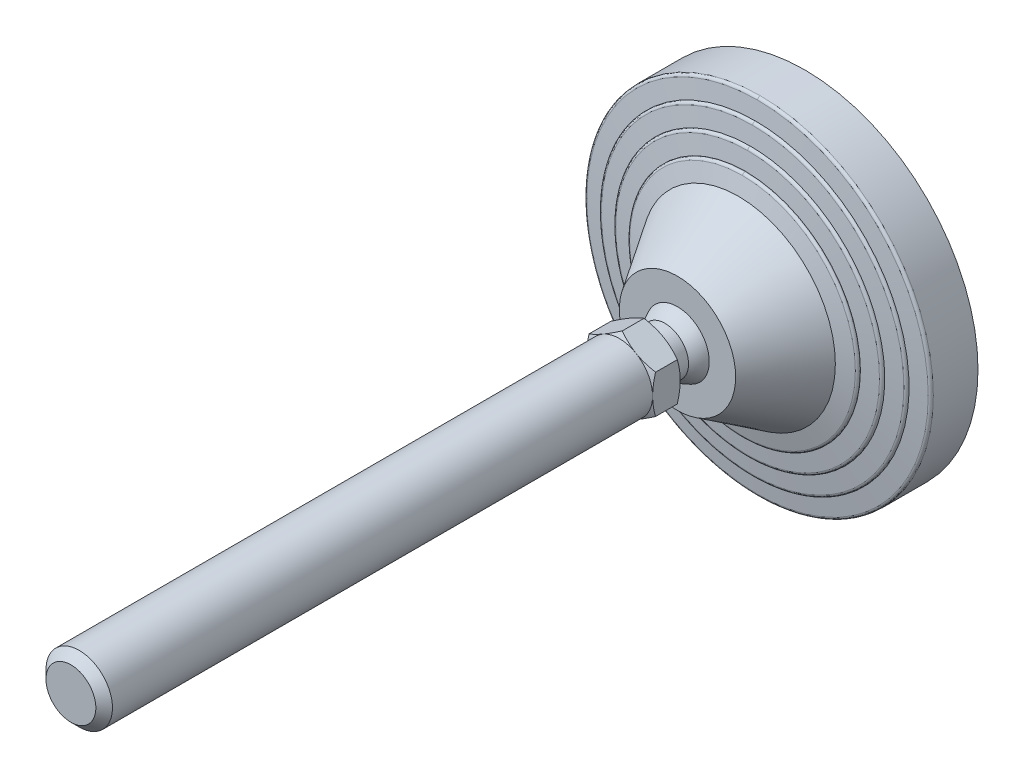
ISO-10303-21;
HEADER;
FILE_DESCRIPTION(('STEP AP214'),'2;1');
FILE_NAME('part.step','',(''),(''),'','','');
FILE_SCHEMA(('AUTOMOTIVE_DESIGN { 1 0 10303 214 1 1 1 1 }'));
ENDSEC;
DATA;
#1=APPLICATION_CONTEXT('core data for automotive mechanical design processes');
#2=APPLICATION_PROTOCOL_DEFINITION('international standard','automotive_design',2000,#1);
#3=PRODUCT_CONTEXT('',#1,'mechanical');
#4=PRODUCT('Part','Part','',(#3));
#5=PRODUCT_RELATED_PRODUCT_CATEGORY('part','',(#4));
#6=PRODUCT_DEFINITION_FORMATION('','',#4);
#7=PRODUCT_DEFINITION_CONTEXT('part definition',#1,'design');
#8=PRODUCT_DEFINITION('design','',#6,#7);
#9=PRODUCT_DEFINITION_SHAPE('','',#8);
#10=(LENGTH_UNIT() NAMED_UNIT(*) SI_UNIT(.MILLI.,.METRE.));
#11=(NAMED_UNIT(*) PLANE_ANGLE_UNIT() SI_UNIT($,.RADIAN.));
#12=(NAMED_UNIT(*) SI_UNIT($,.STERADIAN.) SOLID_ANGLE_UNIT());
#13=UNCERTAINTY_MEASURE_WITH_UNIT(LENGTH_MEASURE(1.E-05),#10,'distance_accuracy_value','');
#14=(GEOMETRIC_REPRESENTATION_CONTEXT(3) GLOBAL_UNCERTAINTY_ASSIGNED_CONTEXT((#13)) GLOBAL_UNIT_ASSIGNED_CONTEXT((#10,
#11,#12)) REPRESENTATION_CONTEXT('',''));
#15=CARTESIAN_POINT('',(0.,0.,0.));
#16=DIRECTION('',(0.,0.,1.));
#17=DIRECTION('',(1.,0.,0.));
#18=AXIS2_PLACEMENT_3D('',#15,#16,#17);
#19=CARTESIAN_POINT('',(-55.851524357,55.66,0.));
#20=DIRECTION('',(0.,0.,1.));
#21=DIRECTION('',(0.,-1.,0.));
#22=AXIS2_PLACEMENT_3D('',#19,#20,#21);
#23=PLANE('',#22);
#24=CARTESIAN_POINT('',(0.,0.,0.));
#25=DIRECTION('',(0.,0.,-1.));
#26=DIRECTION('',(0.,1.,0.));
#27=AXIS2_PLACEMENT_3D('',#24,#25,#26);
#28=CIRCLE('',#27,55.);
#29=CARTESIAN_POINT('',(0.,55.,0.));
#30=VERTEX_POINT('',#29);
#31=EDGE_CURVE('E431',#30,#30,#28,.F.);
#32=ORIENTED_EDGE('',*,*,#31,.F.);
#33=EDGE_LOOP('',(#32));
#34=FACE_BOUND('',#33,.T.);
#35=ADVANCED_FACE('F14',(#34),#23,.F.);
#36=CARTESIAN_POINT('',(0.,0.,3.));
#37=DIRECTION('',(0.,0.,-1.));
#38=DIRECTION('',(0.,1.,0.));
#39=AXIS2_PLACEMENT_3D('',#36,#37,#38);
#40=CYLINDRICAL_SURFACE('',#39,55.);
#41=ORIENTED_EDGE('',*,*,#31,.T.);
#42=EDGE_LOOP('',(#41));
#43=FACE_BOUND('',#42,.T.);
#44=CARTESIAN_POINT('',(0.,0.,3.));
#45=DIRECTION('',(0.,0.,-1.));
#46=DIRECTION('',(0.,1.,0.));
#47=AXIS2_PLACEMENT_3D('',#44,#45,#46);
#48=CIRCLE('',#47,55.);
#49=CARTESIAN_POINT('',(0.,55.,3.));
#50=VERTEX_POINT('',#49);
#51=EDGE_CURVE('E428',#50,#50,#48,.T.);
#52=ORIENTED_EDGE('',*,*,#51,.T.);
#53=EDGE_LOOP('',(#52));
#54=FACE_BOUND('',#53,.T.);
#55=ADVANCED_FACE('F287',(#43,#54),#40,.T.);
#56=CARTESIAN_POINT('',(-63.467641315,63.25,3.));
#57=DIRECTION('',(0.,0.,1.));
#58=DIRECTION('',(0.,-1.,0.));
#59=AXIS2_PLACEMENT_3D('',#56,#57,#58);
#60=PLANE('',#59);
#61=ORIENTED_EDGE('',*,*,#51,.F.);
#62=EDGE_LOOP('',(#61));
#63=FACE_BOUND('',#62,.T.);
#64=CARTESIAN_POINT('',(0.,0.,3.));
#65=DIRECTION('',(0.,0.,-1.));
#66=DIRECTION('',(0.,1.,0.));
#67=AXIS2_PLACEMENT_3D('',#64,#65,#66);
#68=CIRCLE('',#67,62.5);
#69=CARTESIAN_POINT('',(0.,62.5,3.));
#70=VERTEX_POINT('',#69);
#71=EDGE_CURVE('E424',#70,#70,#68,.F.);
#72=ORIENTED_EDGE('',*,*,#71,.F.);
#73=EDGE_LOOP('',(#72));
#74=FACE_BOUND('',#73,.T.);
#75=ADVANCED_FACE('F283',(#63,#74),#60,.F.);
#76=CARTESIAN_POINT('',(0.,0.,19.119206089));
#77=DIRECTION('',(0.,0.,-1.));
#78=DIRECTION('',(0.,1.,0.));
#79=AXIS2_PLACEMENT_3D('',#76,#77,#78);
#80=CYLINDRICAL_SURFACE('',#79,62.5);
#81=ORIENTED_EDGE('',*,*,#71,.T.);
#82=EDGE_LOOP('',(#81));
#83=FACE_BOUND('',#82,.T.);
#84=CARTESIAN_POINT('',(0.,0.,19.119206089));
#85=DIRECTION('',(0.,0.,1.));
#86=DIRECTION('',(0.,-1.,0.));
#87=AXIS2_PLACEMENT_3D('',#84,#85,#86);
#88=CIRCLE('',#87,62.5);
#89=CARTESIAN_POINT('',(-6.4094821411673E-09,-62.5,19.119206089));
#90=VERTEX_POINT('',#89);
#91=CARTESIAN_POINT('',(0.,62.5,19.119206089));
#92=VERTEX_POINT('',#91);
#93=EDGE_CURVE('E583',#90,#92,#88,.T.);
#94=ORIENTED_EDGE('',*,*,#93,.F.);
#95=CARTESIAN_POINT('',(0.,0.,19.119206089));
#96=DIRECTION('',(0.,0.,1.));
#97=DIRECTION('',(0.,-1.,0.));
#98=AXIS2_PLACEMENT_3D('',#95,#96,#97);
#99=CIRCLE('',#98,62.5);
#100=EDGE_CURVE('E427',#92,#90,#99,.T.);
#101=ORIENTED_EDGE('',*,*,#100,.F.);
#102=EDGE_LOOP('',(#94,#101));
#103=FACE_BOUND('',#102,.T.);
#104=ADVANCED_FACE('F286',(#83,#103),#80,.T.);
#105=CARTESIAN_POINT('',(0.,-62.5,19.119206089));
#106=CARTESIAN_POINT('',(-125.,-62.5,19.119206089));
#107=CARTESIAN_POINT('',(-125.,62.5,19.119206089));
#108=CARTESIAN_POINT('',(0.,62.5,19.119206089));
#109=CARTESIAN_POINT('',(0.,-62.5,19.647800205));
#110=CARTESIAN_POINT('',(-125.,-62.5,19.647800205));
#111=CARTESIAN_POINT('',(-125.,62.5,19.647800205));
#112=CARTESIAN_POINT('',(0.,62.5,19.647800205));
#113=CARTESIAN_POINT('',(0.,-62.150618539,20.044466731));
#114=CARTESIAN_POINT('',(-124.301237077,-62.1506185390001,20.044466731));
#115=CARTESIAN_POINT('',(-124.301237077,62.1506185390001,20.044466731));
#116=CARTESIAN_POINT('',(0.,62.150618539,20.044466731));
#117=CARTESIAN_POINT('',(0.,-61.62625428,20.111204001));
#118=CARTESIAN_POINT('',(-123.252508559,-61.6262542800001,20.111204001));
#119=CARTESIAN_POINT('',(-123.252508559,61.6262542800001,20.111204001));
#120=CARTESIAN_POINT('',(0.,61.62625428,20.111204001));
#121=(BOUNDED_SURFACE() B_SPLINE_SURFACE(3,3,((#105,#106,#107,#108),(#109,#110,#111,#112),(#113,
#114,#115,#116),(#117,#118,#119,#120)),.UNSPECIFIED.,.F.,.F.,
.F.) B_SPLINE_SURFACE_WITH_KNOTS((4,4),(4,4),(0.,1.),(0.,1.),
.UNSPECIFIED.) GEOMETRIC_REPRESENTATION_ITEM() RATIONAL_B_SPLINE_SURFACE(((1.,0.333333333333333,
0.333333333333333,1.),(0.833611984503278,0.277870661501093,0.277870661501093,0.833611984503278),
(0.833611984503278,0.277870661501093,0.277870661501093,0.833611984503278),(1.,0.333333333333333,
0.333333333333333,1.))) REPRESENTATION_ITEM('') SURFACE());
#122=CARTESIAN_POINT('',(0.,62.5,19.119206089));
#123=CARTESIAN_POINT('',(0.,62.5,19.647800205));
#124=CARTESIAN_POINT('',(0.,62.150618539,20.044466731));
#125=CARTESIAN_POINT('',(0.,61.62625428,20.111204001));
#126=(BOUNDED_CURVE() B_SPLINE_CURVE(3,(#122,#123,#124,#125),.UNSPECIFIED.,.F.,
.F.) B_SPLINE_CURVE_WITH_KNOTS((4,4),(0.,1.),
.UNSPECIFIED.) CURVE() GEOMETRIC_REPRESENTATION_ITEM() RATIONAL_B_SPLINE_CURVE((1.,
0.833611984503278,0.833611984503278,1.)) REPRESENTATION_ITEM(''));
#127=CARTESIAN_POINT('',(0.,61.6262542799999,20.1112040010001));
#128=VERTEX_POINT('',#127);
#129=EDGE_CURVE('E574',#92,#128,#126,.T.);
#130=CARTESIAN_POINT('',(0.,-62.5,19.119206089));
#131=CARTESIAN_POINT('',(0.,-62.5,19.647800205));
#132=CARTESIAN_POINT('',(0.,-62.150618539,20.044466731));
#133=CARTESIAN_POINT('',(0.,-61.62625428,20.111204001));
#134=(BOUNDED_CURVE() B_SPLINE_CURVE(3,(#130,#131,#132,#133),.UNSPECIFIED.,.F.,
.F.) B_SPLINE_CURVE_WITH_KNOTS((4,4),(0.,1.),
.UNSPECIFIED.) CURVE() GEOMETRIC_REPRESENTATION_ITEM() RATIONAL_B_SPLINE_CURVE((1.,
0.833611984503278,0.833611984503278,1.)) REPRESENTATION_ITEM(''));
#135=CARTESIAN_POINT('',(-1.89596340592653E-08,-61.6262542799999,20.1112040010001));
#136=VERTEX_POINT('',#135);
#137=EDGE_CURVE('E588',#136,#90,#134,.F.);
#138=CARTESIAN_POINT('',(0.,0.,20.1112040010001));
#139=DIRECTION('',(0.,0.,-1.));
#140=DIRECTION('',(0.,1.,0.));
#141=AXIS2_PLACEMENT_3D('',#138,#139,#140);
#142=CIRCLE('',#141,61.62625428);
#143=EDGE_CURVE('E567',#128,#136,#142,.F.);
#144=ORIENTED_EDGE('',*,*,#129,.F.);
#145=ORIENTED_EDGE('',*,*,#100,.T.);
#146=ORIENTED_EDGE('',*,*,#137,.F.);
#147=ORIENTED_EDGE('',*,*,#143,.F.);
#148=EDGE_LOOP('',(#144,#145,#146,#147));
#149=FACE_BOUND('',#148,.T.);
#150=ADVANCED_FACE('F944',(#149),#121,.T.);
#151=CARTESIAN_POINT('',(0.,62.5,19.119206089));
#152=CARTESIAN_POINT('',(125.,62.5,19.119206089));
#153=CARTESIAN_POINT('',(125.,-62.5,19.119206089));
#154=CARTESIAN_POINT('',(0.,-62.5,19.119206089));
#155=CARTESIAN_POINT('',(0.,62.5,19.647800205));
#156=CARTESIAN_POINT('',(125.,62.5,19.647800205));
#157=CARTESIAN_POINT('',(125.,-62.5,19.647800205));
#158=CARTESIAN_POINT('',(0.,-62.5,19.647800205));
#159=CARTESIAN_POINT('',(0.,62.150618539,20.044466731));
#160=CARTESIAN_POINT('',(124.301237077,62.1506185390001,20.044466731));
#161=CARTESIAN_POINT('',(124.301237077,-62.1506185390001,20.044466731));
#162=CARTESIAN_POINT('',(0.,-62.150618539,20.044466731));
#163=CARTESIAN_POINT('',(0.,61.62625428,20.111204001));
#164=CARTESIAN_POINT('',(123.252508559,61.6262542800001,20.111204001));
#165=CARTESIAN_POINT('',(123.252508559,-61.6262542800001,20.111204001));
#166=CARTESIAN_POINT('',(0.,-61.62625428,20.111204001));
#167=(BOUNDED_SURFACE() B_SPLINE_SURFACE(3,3,((#151,#152,#153,#154),(#155,#156,#157,#158),(#159,
#160,#161,#162),(#163,#164,#165,#166)),.UNSPECIFIED.,.F.,.F.,
.F.) B_SPLINE_SURFACE_WITH_KNOTS((4,4),(4,4),(0.,1.),(0.,1.),
.UNSPECIFIED.) GEOMETRIC_REPRESENTATION_ITEM() RATIONAL_B_SPLINE_SURFACE(((1.,0.333333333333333,
0.333333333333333,1.),(0.833611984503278,0.277870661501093,0.277870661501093,0.833611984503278),
(0.833611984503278,0.277870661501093,0.277870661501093,0.833611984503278),(1.,0.333333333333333,
0.333333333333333,1.))) REPRESENTATION_ITEM('') SURFACE());
#168=CARTESIAN_POINT('',(0.,0.,20.1112040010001));
#169=DIRECTION('',(0.,0.,-1.));
#170=DIRECTION('',(0.,1.,0.));
#171=AXIS2_PLACEMENT_3D('',#168,#169,#170);
#172=CIRCLE('',#171,61.62625428);
#173=EDGE_CURVE('E573',#136,#128,#172,.F.);
#174=ORIENTED_EDGE('',*,*,#93,.T.);
#175=ORIENTED_EDGE('',*,*,#129,.T.);
#176=ORIENTED_EDGE('',*,*,#173,.F.);
#177=ORIENTED_EDGE('',*,*,#137,.T.);
#178=EDGE_LOOP('',(#174,#175,#176,#177));
#179=FACE_BOUND('',#178,.T.);
#180=ADVANCED_FACE('F409',(#179),#167,.T.);
#181=CARTESIAN_POINT('',(0.,0.,20.890909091));
#182=DIRECTION('',(0.,0.,-1.));
#183=DIRECTION('',(1.,0.,0.));
#184=AXIS2_PLACEMENT_3D('',#181,#182,#183);
#185=CONICAL_SURFACE('',#184,55.5,1.44420419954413);
#186=ORIENTED_EDGE('',*,*,#143,.T.);
#187=ORIENTED_EDGE('',*,*,#173,.T.);
#188=EDGE_LOOP('',(#186,#187));
#189=FACE_BOUND('',#188,.T.);
#190=CARTESIAN_POINT('',(-1.13830957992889E-08,-55.5,20.890909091));
#191=CARTESIAN_POINT('',(0.666810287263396,-55.5000058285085,20.890909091));
#192=CARTESIAN_POINT('',(1.33362158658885,-55.4879831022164,20.890909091));
#193=CARTESIAN_POINT('',(2.66828219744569,-55.4398527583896,20.890909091));
#194=CARTESIAN_POINT('',(3.33612903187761,-55.4036764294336,20.890909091));
#195=CARTESIAN_POINT('',(4.67008368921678,-55.3072108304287,20.890909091));
#196=CARTESIAN_POINT('',(5.33619149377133,-55.2469213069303,20.890909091));
#197=CARTESIAN_POINT('',(6.66630694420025,-55.1022519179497,20.890909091));
#198=CARTESIAN_POINT('',(7.33031261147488,-55.0178537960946,20.890909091));
#199=CARTESIAN_POINT('',(8.65488946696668,-54.8250946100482,20.890909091));
#200=CARTESIAN_POINT('',(9.31546019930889,-54.7167304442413,20.890909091));
#201=CARTESIAN_POINT('',(11.3032442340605,-54.3535835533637,20.890909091));
#202=CARTESIAN_POINT('',(12.6239565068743,-54.0621103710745,20.890909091));
#203=CARTESIAN_POINT('',(15.2407929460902,-53.383483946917,20.890909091));
#204=CARTESIAN_POINT('',(16.5369104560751,-52.9963051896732,20.890909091));
#205=CARTESIAN_POINT('',(19.0989356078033,-52.1278427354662,20.890909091));
#206=CARTESIAN_POINT('',(20.3648068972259,-51.6464516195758,20.890909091));
#207=CARTESIAN_POINT('',(22.8579438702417,-50.5924539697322,20.890909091));
#208=CARTESIAN_POINT('',(24.0852091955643,-50.0198465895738,20.890909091));
#209=CARTESIAN_POINT('',(26.6786676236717,-48.6922162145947,20.890909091));
#210=CARTESIAN_POINT('',(28.0374663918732,-47.9226902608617,20.890909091));
#211=CARTESIAN_POINT('',(30.6855194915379,-46.2718474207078,20.890909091));
#212=CARTESIAN_POINT('',(31.9747656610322,-45.3905174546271,20.890909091));
#213=CARTESIAN_POINT('',(34.4745529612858,-43.5222940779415,20.890909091));
#214=CARTESIAN_POINT('',(35.6850872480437,-42.5353915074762,20.890909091));
#215=CARTESIAN_POINT('',(38.0186685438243,-40.4631409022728,20.890909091));
#216=CARTESIAN_POINT('',(39.1417181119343,-39.3777957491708,20.890909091));
#217=CARTESIAN_POINT('',(41.2923479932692,-37.1163936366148,20.890909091));
#218=CARTESIAN_POINT('',(42.3199319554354,-35.9403401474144,20.890909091));
#219=CARTESIAN_POINT('',(44.2723789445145,-33.505838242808,20.890909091));
#220=CARTESIAN_POINT('',(45.1972412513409,-32.2473892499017,20.890909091));
#221=CARTESIAN_POINT('',(46.9376312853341,-29.6570957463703,20.890909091));
#222=CARTESIAN_POINT('',(47.7531628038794,-28.3252537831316,20.890909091));
#223=CARTESIAN_POINT('',(49.2691299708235,-25.5976050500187,20.890909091));
#224=CARTESIAN_POINT('',(49.9695658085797,-24.2017983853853,20.890909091));
#225=CARTESIAN_POINT('',(51.2503706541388,-21.3561258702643,20.890909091));
#226=CARTESIAN_POINT('',(51.8307383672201,-19.906259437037,20.890909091));
#227=CARTESIAN_POINT('',(52.8672716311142,-16.9627885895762,20.890909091));
#228=CARTESIAN_POINT('',(53.323437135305,-15.4691841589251,20.890909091));
#229=CARTESIAN_POINT('',(54.1083272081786,-12.4488388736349,20.890909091));
#230=CARTESIAN_POINT('',(54.4370503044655,-10.9220976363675,20.890909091));
#231=CARTESIAN_POINT('',(54.9647110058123,-7.84634988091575,20.890909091));
#232=CARTESIAN_POINT('',(55.1636486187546,-6.29734336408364,20.890909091));
#233=CARTESIAN_POINT('',(55.4303245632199,-3.18807153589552,20.890909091));
#234=CARTESIAN_POINT('',(55.4980623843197,-1.62780618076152,20.890909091));
#235=CARTESIAN_POINT('',(55.5018556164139,1.49288460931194,20.890909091));
#236=CARTESIAN_POINT('',(55.4379110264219,3.0533100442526,20.890909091));
#237=CARTESIAN_POINT('',(55.1787965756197,6.16319684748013,20.890909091));
#238=CARTESIAN_POINT('',(54.9836292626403,7.71265842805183,20.890909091));
#239=CARTESIAN_POINT('',(54.4634594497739,10.7896325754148,20.890909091));
#240=CARTESIAN_POINT('',(54.1384569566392,12.3171451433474,20.890909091));
#241=CARTESIAN_POINT('',(53.3609336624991,15.3393372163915,20.890909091));
#242=CARTESIAN_POINT('',(52.908414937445,16.8340172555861,20.890909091));
#243=CARTESIAN_POINT('',(51.8790738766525,19.7799443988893,20.890909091));
#244=CARTESIAN_POINT('',(51.3022515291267,21.2311914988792,20.890909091));
#245=CARTESIAN_POINT('',(50.0283709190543,24.0800097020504,20.890909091));
#246=CARTESIAN_POINT('',(49.3313064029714,25.4775780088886,20.890909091));
#247=CARTESIAN_POINT('',(47.8219174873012,28.209022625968,20.890909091));
#248=CARTESIAN_POINT('',(47.0095931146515,29.5428989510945,20.890909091));
#249=CARTESIAN_POINT('',(45.2754391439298,32.1375097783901,20.890909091));
#250=CARTESIAN_POINT('',(44.3536065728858,33.3982422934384,20.890909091));
#251=CARTESIAN_POINT('',(42.4069961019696,35.8375708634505,20.890909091));
#252=CARTESIAN_POINT('',(41.3822180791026,37.016166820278,20.890909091));
#253=CARTESIAN_POINT('',(39.2371577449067,39.2826945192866,20.890909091));
#254=CARTESIAN_POINT('',(38.1168855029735,40.3706357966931,20.890909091));
#255=CARTESIAN_POINT('',(35.7885615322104,42.4483529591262,20.890909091));
#256=CARTESIAN_POINT('',(34.5805102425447,43.4381293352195,20.890909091));
#257=CARTESIAN_POINT('',(32.5014047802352,44.9999063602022,20.890909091));
#258=CARTESIAN_POINT('',(31.6521856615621,45.6012216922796,20.890909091));
#259=CARTESIAN_POINT('',(29.9212415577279,46.7552239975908,20.890909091));
#260=CARTESIAN_POINT('',(29.0395163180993,47.3079105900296,20.890909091));
#261=CARTESIAN_POINT('',(27.2463975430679,48.3628576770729,20.890909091));
#262=CARTESIAN_POINT('',(26.3350034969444,48.8651173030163,20.890909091));
#263=CARTESIAN_POINT('',(24.4853750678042,49.8176528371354,20.890909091));
#264=CARTESIAN_POINT('',(23.5471392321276,50.2679259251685,20.890909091));
#265=CARTESIAN_POINT('',(21.6468644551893,51.1150215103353,20.890909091));
#266=CARTESIAN_POINT('',(20.6848259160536,51.5118449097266,20.890909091));
#267=CARTESIAN_POINT('',(18.7400290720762,52.250772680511,20.890909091));
#268=CARTESIAN_POINT('',(17.7572723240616,52.5928811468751,20.890909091));
#269=CARTESIAN_POINT('',(15.8636176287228,53.1929617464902,20.890909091));
#270=CARTESIAN_POINT('',(14.9542390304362,53.4557406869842,20.890909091));
#271=CARTESIAN_POINT('',(13.1232854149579,53.9344479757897,20.890909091));
#272=CARTESIAN_POINT('',(12.2017111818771,54.1503793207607,20.890909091));
#273=CARTESIAN_POINT('',(10.3487557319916,54.5348378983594,20.890909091));
#274=CARTESIAN_POINT('',(9.41737477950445,54.7033664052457,20.890909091));
#275=CARTESIAN_POINT('',(7.54728204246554,54.9925789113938,20.890909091));
#276=CARTESIAN_POINT('',(6.60857079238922,55.1132663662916,20.890909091));
#277=CARTESIAN_POINT('',(4.72616569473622,55.3064952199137,20.890909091));
#278=CARTESIAN_POINT('',(3.78247163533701,55.3790345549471,20.890909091));
#279=CARTESIAN_POINT('',(1.89251924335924,55.4758006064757,20.890909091));
#280=CARTESIAN_POINT('',(0.946260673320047,55.5000226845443,20.890909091));
#281=CARTESIAN_POINT('',(-1.66116219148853E-09,55.5,20.890909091));
#282=B_SPLINE_CURVE_WITH_KNOTS('',3,(#190,#191,#192,#193,#194,#195,#196,#197,#198,#199,#200,
#201,#202,#203,#204,#205,#206,#207,#208,#209,#210,#211,#212,#213,#214,#215,#216,#217,#218,#219,
#220,#221,#222,#223,#224,#225,#226,#227,#228,#229,#230,#231,#232,#233,#234,#235,#236,#237,#238,
#239,#240,#241,#242,#243,#244,#245,#246,#247,#248,#249,#250,#251,#252,#253,#254,#255,#256,#257,
#258,#259,#260,#261,#262,#263,#264,#265,#266,#267,#268,#269,#270,#271,#272,#273,#274,#275,#276,
#277,#278,#279,#280,#281),.UNSPECIFIED.,.F.,.F.,(4,2,2,2,2,2,2,2,2,2,2,2,2,2,2,2,2,2,2,2,2,2,2,
2,2,2,2,2,2,2,2,2,2,2,2,2,2,2,2,2,2,2,2,2,2,4),(0.,2.00032482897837,4.00636450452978,
6.01242526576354,8.02000917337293,10.0278530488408,14.0813911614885,18.1360111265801,
22.1952813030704,26.254589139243,30.9336173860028,35.6131935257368,40.2931760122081,
44.9730215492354,49.6526881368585,54.3323875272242,59.011924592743,63.6914539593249,
68.3710337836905,73.0506153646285,77.7302510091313,82.4098863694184,87.0895399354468,
91.7691935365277,96.4487562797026,101.128318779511,105.80780510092,110.487291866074,
115.167022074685,119.846751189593,124.526607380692,129.206469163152,133.885838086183,
138.565183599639,141.685351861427,144.805544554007,147.925790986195,151.046206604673,
154.16656954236,157.286698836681,160.12523673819,162.963593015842,165.801872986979,
168.639947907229,171.478144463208,174.316613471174),.UNSPECIFIED.);
#283=CARTESIAN_POINT('',(-1.13832391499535E-08,-55.5,20.895966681));
#284=VERTEX_POINT('',#283);
#285=CARTESIAN_POINT('',(-1.66118325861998E-09,55.5,20.895966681));
#286=VERTEX_POINT('',#285);
#287=EDGE_CURVE('E390',#284,#286,#282,.T.);
#288=ORIENTED_EDGE('',*,*,#287,.F.);
#289=CARTESIAN_POINT('',(-1.66117986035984E-09,55.5,20.890909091));
#290=CARTESIAN_POINT('',(-0.666810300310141,55.5000058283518,20.890909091));
#291=CARTESIAN_POINT('',(-1.33362159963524,55.4879831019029,20.890909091));
#292=CARTESIAN_POINT('',(-2.66828221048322,55.4398527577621,20.890909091));
#293=CARTESIAN_POINT('',(-3.33612904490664,55.403676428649,20.890909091));
#294=CARTESIAN_POINT('',(-4.67008370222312,55.3072108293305,20.890909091));
#295=CARTESIAN_POINT('',(-5.33619150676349,55.2469213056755,20.890909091));
#296=CARTESIAN_POINT('',(-6.66630695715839,55.1022519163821,20.890909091));
#297=CARTESIAN_POINT('',(-7.33031262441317,55.0178537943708,20.890909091));
#298=CARTESIAN_POINT('',(-8.65488947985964,54.8250946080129,20.890909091));
#299=CARTESIAN_POINT('',(-9.31546021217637,54.7167304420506,20.890909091));
#300=CARTESIAN_POINT('',(-11.3032442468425,54.3535835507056,20.890909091));
#301=CARTESIAN_POINT('',(-12.6239565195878,54.0621103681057,20.890909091));
#302=CARTESIAN_POINT('',(-15.2407929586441,53.3834839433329,20.890909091));
#303=CARTESIAN_POINT('',(-16.536910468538,52.9963051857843,20.890909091));
#304=CARTESIAN_POINT('',(-19.0989356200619,52.1278427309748,20.890909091));
#305=CARTESIAN_POINT('',(-20.3648069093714,51.6464516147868,20.890909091));
#306=CARTESIAN_POINT('',(-22.8579438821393,50.5924539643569,20.890909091));
#307=CARTESIAN_POINT('',(-24.0852092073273,50.0198465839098,20.890909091));
#308=CARTESIAN_POINT('',(-26.6786676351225,48.6922162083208,20.890909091));
#309=CARTESIAN_POINT('',(-28.037466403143,47.9226902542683,20.890909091));
#310=CARTESIAN_POINT('',(-30.6855195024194,46.2718474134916,20.890909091));
#311=CARTESIAN_POINT('',(-31.9747656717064,45.3905174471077,20.890909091));
#312=CARTESIAN_POINT('',(-34.4745529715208,43.5222940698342,20.890909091));
#313=CARTESIAN_POINT('',(-35.6850872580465,42.5353914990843,20.890909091));
#314=CARTESIAN_POINT('',(-38.0186685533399,40.4631408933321,20.890909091));
#315=CARTESIAN_POINT('',(-39.1417181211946,39.377795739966,20.890909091));
#316=CARTESIAN_POINT('',(-41.2923480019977,37.1163936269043,20.890909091));
#317=CARTESIAN_POINT('',(-42.3199319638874,35.9403401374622,20.890909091));
#318=CARTESIAN_POINT('',(-44.272378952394,33.5058382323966,20.890909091));
#319=CARTESIAN_POINT('',(-45.1972412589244,32.2473892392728,20.890909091));
#320=CARTESIAN_POINT('',(-46.9376312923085,29.6570957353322,20.890909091));
#321=CARTESIAN_POINT('',(-47.7531628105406,28.3252537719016,20.890909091));
#322=CARTESIAN_POINT('',(-49.2691299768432,25.5976050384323,20.890909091));
#323=CARTESIAN_POINT('',(-49.9695658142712,24.2017983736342,20.890909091));
#324=CARTESIAN_POINT('',(-51.2503706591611,21.3561258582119,20.890909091));
#325=CARTESIAN_POINT('',(-51.8307383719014,19.9062594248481,20.890909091));
#326=CARTESIAN_POINT('',(-52.8672716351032,16.9627885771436,20.890909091));
#327=CARTESIAN_POINT('',(-53.3234371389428,15.4691841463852,20.890909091));
#328=CARTESIAN_POINT('',(-54.1083272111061,12.4488388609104,20.890909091));
#329=CARTESIAN_POINT('',(-54.437050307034,10.9220976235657,20.890909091));
#330=CARTESIAN_POINT('',(-54.9647110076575,7.84634986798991,20.890909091));
#331=CARTESIAN_POINT('',(-55.1636486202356,6.29734335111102,20.890909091));
#332=CARTESIAN_POINT('',(-55.4303245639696,3.18807152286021,20.890909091));
#333=CARTESIAN_POINT('',(-55.4980623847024,1.62780616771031,20.890909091));
#334=CARTESIAN_POINT('',(-55.5018556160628,-1.49288462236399,20.890909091));
#335=CARTESIAN_POINT('',(-55.4379110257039,-3.05331005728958,20.890909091));
#336=CARTESIAN_POINT('',(-55.1787965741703,-6.16319686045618,20.890909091));
#337=CARTESIAN_POINT('',(-54.9836292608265,-7.71265844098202,20.890909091));
#338=CARTESIAN_POINT('',(-54.4634594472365,-10.7896325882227,20.890909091));
#339=CARTESIAN_POINT('',(-54.1384569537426,-12.317145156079,20.890909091));
#340=CARTESIAN_POINT('',(-53.3609336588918,-15.3393372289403,20.890909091));
#341=CARTESIAN_POINT('',(-52.9084149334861,-16.8340172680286,20.890909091));
#342=CARTESIAN_POINT('',(-51.8790738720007,-19.77994441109,20.890909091));
#343=CARTESIAN_POINT('',(-51.3022515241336,-21.2311915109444,20.890909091));
#344=CARTESIAN_POINT('',(-50.0283709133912,-24.080009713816,20.890909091));
#345=CARTESIAN_POINT('',(-49.3313063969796,-25.4775780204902,20.890909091));
#346=CARTESIAN_POINT('',(-47.8219174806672,-28.2090226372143,20.890909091));
#347=CARTESIAN_POINT('',(-47.0095931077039,-29.5428989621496,20.890909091));
#348=CARTESIAN_POINT('',(-45.2754391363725,-32.1375097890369,20.890909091));
#349=CARTESIAN_POINT('',(-44.3536065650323,-33.398242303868,20.890909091));
#350=CARTESIAN_POINT('',(-42.4069960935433,-35.8375708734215,20.890909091));
#351=CARTESIAN_POINT('',(-41.3822180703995,-37.0161668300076,20.890909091));
#352=CARTESIAN_POINT('',(-39.2371577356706,-39.2826945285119,20.890909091));
#353=CARTESIAN_POINT('',(-38.1168854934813,-40.3706358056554,20.890909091));
#354=CARTESIAN_POINT('',(-35.7885615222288,-42.4483529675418,20.890909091));
#355=CARTESIAN_POINT('',(-34.5805102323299,-43.4381293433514,20.890909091));
#356=CARTESIAN_POINT('',(-32.5014047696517,-44.9999063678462,20.890909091));
#357=CARTESIAN_POINT('',(-31.6521856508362,-45.6012216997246,20.890909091));
#358=CARTESIAN_POINT('',(-29.9212415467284,-46.75522400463,20.890909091));
#359=CARTESIAN_POINT('',(-29.0395163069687,-47.307910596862,20.890909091));
#360=CARTESIAN_POINT('',(-27.2463975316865,-48.3628576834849,20.890909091));
#361=CARTESIAN_POINT('',(-26.3350034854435,-48.8651173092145,20.890909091));
#362=CARTESIAN_POINT('',(-24.4853750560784,-49.8176528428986,20.890909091));
#363=CARTESIAN_POINT('',(-23.5471392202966,-50.2679259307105,20.890909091));
#364=CARTESIAN_POINT('',(-21.6468644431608,-51.1150215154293,20.890909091));
#365=CARTESIAN_POINT('',(-20.6848259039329,-51.5118449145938,20.890909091));
#366=CARTESIAN_POINT('',(-18.7400290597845,-52.2507726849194,20.890909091));
#367=CARTESIAN_POINT('',(-17.7572723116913,-52.5928811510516,20.890909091));
#368=CARTESIAN_POINT('',(-15.86361761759,-53.1929617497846,20.890909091));
#369=CARTESIAN_POINT('',(-14.9542390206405,-53.455740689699,20.890909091));
#370=CARTESIAN_POINT('',(-13.1232854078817,-53.9344479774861,20.890909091));
#371=CARTESIAN_POINT('',(-12.2017111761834,-54.1503793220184,20.890909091));
#372=CARTESIAN_POINT('',(-10.3487557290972,-54.5348378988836,20.890909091));
#373=CARTESIAN_POINT('',(-9.4173747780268,-54.7033664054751,20.890909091));
#374=CARTESIAN_POINT('',(-7.54728204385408,-54.9925789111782,20.890909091));
#375=CARTESIAN_POINT('',(-6.60857079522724,-55.1132663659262,20.890909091));
#376=CARTESIAN_POINT('',(-4.72616570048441,-55.3064952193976,20.890909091));
#377=CARTESIAN_POINT('',(-3.78247164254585,-55.3790345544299,20.890909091));
#378=CARTESIAN_POINT('',(-1.89251925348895,-55.4758006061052,20.890909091));
#379=CARTESIAN_POINT('',(-0.94626068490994,-55.5000226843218,20.890909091));
#380=CARTESIAN_POINT('',(-1.13832323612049E-08,-55.5,20.890909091));
#381=B_SPLINE_CURVE_WITH_KNOTS('',3,(#289,#290,#291,#292,#293,#294,#295,#296,#297,#298,#299,
#300,#301,#302,#303,#304,#305,#306,#307,#308,#309,#310,#311,#312,#313,#314,#315,#316,#317,#318,
#319,#320,#321,#322,#323,#324,#325,#326,#327,#328,#329,#330,#331,#332,#333,#334,#335,#336,#337,
#338,#339,#340,#341,#342,#343,#344,#345,#346,#347,#348,#349,#350,#351,#352,#353,#354,#355,#356,
#357,#358,#359,#360,#361,#362,#363,#364,#365,#366,#367,#368,#369,#370,#371,#372,#373,#374,#375,
#376,#377,#378,#379,#380),.UNSPECIFIED.,.F.,.F.,(4,2,2,2,2,2,2,2,2,2,2,2,2,2,2,2,2,2,2,2,2,2,2,
2,2,2,2,2,2,2,2,2,2,2,2,2,2,2,2,2,2,2,2,2,2,4),(0.,2.00032482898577,4.00636450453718,
6.01242526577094,8.02000917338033,10.0278530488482,14.0813911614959,18.1360111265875,
22.1952813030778,26.2545891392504,30.9336173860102,35.6131935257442,40.2931760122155,
44.9730215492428,49.652688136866,54.3323875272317,59.0119245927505,63.6914539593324,
68.3710337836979,73.0506153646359,77.7302510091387,82.4098863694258,87.0895399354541,
91.769193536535,96.44875627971,101.128318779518,105.807805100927,110.487291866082,
115.167022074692,119.846751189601,124.526607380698,129.206469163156,133.885838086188,
138.565183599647,141.685351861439,144.805544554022,147.925790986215,151.04620660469,
154.166569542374,157.286698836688,160.125236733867,162.963593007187,165.801872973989,
168.639947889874,171.47814444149,174.316613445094),.UNSPECIFIED.);
#382=EDGE_CURVE('E402',#286,#284,#381,.T.);
#383=ORIENTED_EDGE('',*,*,#382,.F.);
#384=EDGE_LOOP('',(#288,#383));
#385=FACE_BOUND('',#384,.T.);
#386=ADVANCED_FACE('F404',(#189,#385),#185,.T.);
#387=CARTESIAN_POINT('',(0.,-55.5,20.887804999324));
#388=CARTESIAN_POINT('',(-111.,-55.5000000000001,20.887804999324));
#389=CARTESIAN_POINT('',(-111.,55.5000000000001,20.887804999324));
#390=CARTESIAN_POINT('',(0.,55.5,20.887804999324));
#391=CARTESIAN_POINT('',(0.,-55.5,20.892211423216));
#392=CARTESIAN_POINT('',(-111.,-55.5000000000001,20.892211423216));
#393=CARTESIAN_POINT('',(-111.,55.5000000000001,20.892211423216));
#394=CARTESIAN_POINT('',(0.,55.5,20.892211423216));
#395=CARTESIAN_POINT('',(0.,-55.5,20.896617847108));
#396=CARTESIAN_POINT('',(-111.,-55.5000000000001,20.896617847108));
#397=CARTESIAN_POINT('',(-111.,55.5000000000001,20.896617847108));
#398=CARTESIAN_POINT('',(0.,55.5,20.896617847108));
#399=CARTESIAN_POINT('',(0.,-55.5,20.901024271));
#400=CARTESIAN_POINT('',(-111.,-55.5000000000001,20.901024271));
#401=CARTESIAN_POINT('',(-111.,55.5000000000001,20.901024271));
#402=CARTESIAN_POINT('',(0.,55.5,20.901024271));
#403=CARTESIAN_POINT('',(0.,-55.5000000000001,21.429618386));
#404=CARTESIAN_POINT('',(-111.,-55.5,21.429618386));
#405=CARTESIAN_POINT('',(-111.,55.5,21.429618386));
#406=CARTESIAN_POINT('',(0.,55.5000000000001,21.429618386));
#407=CARTESIAN_POINT('',(0.,-55.150618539,21.826284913));
#408=CARTESIAN_POINT('',(-110.301237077,-55.150618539,21.826284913));
#409=CARTESIAN_POINT('',(-110.301237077,55.150618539,21.826284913));
#410=CARTESIAN_POINT('',(0.,55.150618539,21.826284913));
#411=CARTESIAN_POINT('',(0.,-54.62625428,21.893022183));
#412=CARTESIAN_POINT('',(-109.252508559,-54.62625428,21.893022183));
#413=CARTESIAN_POINT('',(-109.252508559,54.62625428,21.893022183));
#414=CARTESIAN_POINT('',(0.,54.62625428,21.893022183));
#415=(BOUNDED_SURFACE() B_SPLINE_SURFACE(3,3,((#387,#388,#389,#390),(#391,#392,#393,#394),(#395,
#396,#397,#398),(#399,#400,#401,#402),(#403,#404,#405,#406),(#407,#408,#409,#410),(#411,#412,
#413,#414)),.UNSPECIFIED.,.F.,.F.,.F.) B_SPLINE_SURFACE_WITH_KNOTS((4,3,4),(4,4),(-0.01,0.,1.),
(0.,1.),.UNSPECIFIED.) GEOMETRIC_REPRESENTATION_ITEM() RATIONAL_B_SPLINE_SURFACE(((1.,
0.333333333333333,0.333333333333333,1.),(1.,0.333333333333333,0.333333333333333,1.),(1.,
0.333333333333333,0.333333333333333,1.),(1.,0.333333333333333,0.333333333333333,1.),
(0.833611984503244,0.277870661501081,0.277870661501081,0.833611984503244),(0.833611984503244,
0.277870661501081,0.277870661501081,0.833611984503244),(1.,0.333333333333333,0.333333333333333,1.))) REPRESENTATION_ITEM('') SURFACE());
#416=CARTESIAN_POINT('',(0.,55.5,20.901024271));
#417=CARTESIAN_POINT('',(0.,55.5000000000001,21.429618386));
#418=CARTESIAN_POINT('',(0.,55.150618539,21.826284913));
#419=CARTESIAN_POINT('',(0.,54.62625428,21.893022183));
#420=(BOUNDED_CURVE() B_SPLINE_CURVE(3,(#416,#417,#418,#419),.UNSPECIFIED.,.F.,
.F.) B_SPLINE_CURVE_WITH_KNOTS((4,4),(0.,1.),
.UNSPECIFIED.) CURVE() GEOMETRIC_REPRESENTATION_ITEM() RATIONAL_B_SPLINE_CURVE((1.,
0.833611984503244,0.833611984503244,1.)) REPRESENTATION_ITEM(''));
#421=CARTESIAN_POINT('',(0.,54.6262542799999,21.893022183));
#422=VERTEX_POINT('',#421);
#423=EDGE_CURVE('E393',#286,#422,#420,.T.);
#424=CARTESIAN_POINT('',(0.,-55.5,20.901024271));
#425=CARTESIAN_POINT('',(0.,-55.5000000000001,21.429618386));
#426=CARTESIAN_POINT('',(0.,-55.150618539,21.826284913));
#427=CARTESIAN_POINT('',(0.,-54.62625428,21.893022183));
#428=(BOUNDED_CURVE() B_SPLINE_CURVE(3,(#424,#425,#426,#427),.UNSPECIFIED.,.F.,
.F.) B_SPLINE_CURVE_WITH_KNOTS((4,4),(0.,1.),
.UNSPECIFIED.) CURVE() GEOMETRIC_REPRESENTATION_ITEM() RATIONAL_B_SPLINE_CURVE((1.,
0.833611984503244,0.833611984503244,1.)) REPRESENTATION_ITEM(''));
#429=CARTESIAN_POINT('',(-1.68060480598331E-08,-54.6262542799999,21.893022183));
#430=VERTEX_POINT('',#429);
#431=EDGE_CURVE('E394',#430,#284,#428,.F.);
#432=CARTESIAN_POINT('',(0.,0.,21.893022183));
#433=DIRECTION('',(0.,0.,-1.));
#434=DIRECTION('',(0.,1.,0.));
#435=AXIS2_PLACEMENT_3D('',#432,#433,#434);
#436=CIRCLE('',#435,54.62625428);
#437=EDGE_CURVE('E539',#422,#430,#436,.F.);
#438=ORIENTED_EDGE('',*,*,#423,.F.);
#439=ORIENTED_EDGE('',*,*,#382,.T.);
#440=ORIENTED_EDGE('',*,*,#431,.F.);
#441=ORIENTED_EDGE('',*,*,#437,.F.);
#442=EDGE_LOOP('',(#438,#439,#440,#441));
#443=FACE_BOUND('',#442,.T.);
#444=ADVANCED_FACE('F408',(#443),#415,.T.);
#445=CARTESIAN_POINT('',(0.,55.5,20.887804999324));
#446=CARTESIAN_POINT('',(111.,55.5000000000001,20.887804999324));
#447=CARTESIAN_POINT('',(111.,-55.5000000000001,20.887804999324));
#448=CARTESIAN_POINT('',(0.,-55.5,20.887804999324));
#449=CARTESIAN_POINT('',(0.,55.5,20.892211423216));
#450=CARTESIAN_POINT('',(111.,55.5000000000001,20.892211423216));
#451=CARTESIAN_POINT('',(111.,-55.5000000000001,20.892211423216));
#452=CARTESIAN_POINT('',(0.,-55.5,20.892211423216));
#453=CARTESIAN_POINT('',(0.,55.5,20.896617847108));
#454=CARTESIAN_POINT('',(111.,55.5000000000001,20.896617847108));
#455=CARTESIAN_POINT('',(111.,-55.5000000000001,20.896617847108));
#456=CARTESIAN_POINT('',(0.,-55.5,20.896617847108));
#457=CARTESIAN_POINT('',(0.,55.5,20.901024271));
#458=CARTESIAN_POINT('',(111.,55.5000000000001,20.901024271));
#459=CARTESIAN_POINT('',(111.,-55.5000000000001,20.901024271));
#460=CARTESIAN_POINT('',(0.,-55.5,20.901024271));
#461=CARTESIAN_POINT('',(0.,55.5000000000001,21.429618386));
#462=CARTESIAN_POINT('',(111.,55.5,21.429618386));
#463=CARTESIAN_POINT('',(111.,-55.5,21.429618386));
#464=CARTESIAN_POINT('',(0.,-55.5000000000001,21.429618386));
#465=CARTESIAN_POINT('',(0.,55.150618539,21.826284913));
#466=CARTESIAN_POINT('',(110.301237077,55.150618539,21.826284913));
#467=CARTESIAN_POINT('',(110.301237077,-55.150618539,21.826284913));
#468=CARTESIAN_POINT('',(0.,-55.150618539,21.826284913));
#469=CARTESIAN_POINT('',(0.,54.62625428,21.893022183));
#470=CARTESIAN_POINT('',(109.252508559,54.62625428,21.893022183));
#471=CARTESIAN_POINT('',(109.252508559,-54.62625428,21.893022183));
#472=CARTESIAN_POINT('',(0.,-54.62625428,21.893022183));
#473=(BOUNDED_SURFACE() B_SPLINE_SURFACE(3,3,((#445,#446,#447,#448),(#449,#450,#451,#452),(#453,
#454,#455,#456),(#457,#458,#459,#460),(#461,#462,#463,#464),(#465,#466,#467,#468),(#469,#470,
#471,#472)),.UNSPECIFIED.,.F.,.F.,.F.) B_SPLINE_SURFACE_WITH_KNOTS((4,3,4),(4,4),(-0.01,0.,1.),
(0.,1.),.UNSPECIFIED.) GEOMETRIC_REPRESENTATION_ITEM() RATIONAL_B_SPLINE_SURFACE(((1.,
0.333333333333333,0.333333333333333,1.),(1.,0.333333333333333,0.333333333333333,1.),(1.,
0.333333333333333,0.333333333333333,1.),(1.,0.333333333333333,0.333333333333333,1.),
(0.833611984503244,0.277870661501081,0.277870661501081,0.833611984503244),(0.833611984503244,
0.277870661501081,0.277870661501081,0.833611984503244),(1.,0.333333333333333,0.333333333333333,1.))) REPRESENTATION_ITEM('') SURFACE());
#474=CARTESIAN_POINT('',(0.,0.,21.893022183));
#475=DIRECTION('',(0.,0.,-1.));
#476=DIRECTION('',(0.,1.,0.));
#477=AXIS2_PLACEMENT_3D('',#474,#475,#476);
#478=CIRCLE('',#477,54.62625428);
#479=EDGE_CURVE('E545',#430,#422,#478,.F.);
#480=ORIENTED_EDGE('',*,*,#287,.T.);
#481=ORIENTED_EDGE('',*,*,#423,.T.);
#482=ORIENTED_EDGE('',*,*,#479,.F.);
#483=ORIENTED_EDGE('',*,*,#431,.T.);
#484=EDGE_LOOP('',(#480,#481,#482,#483));
#485=FACE_BOUND('',#484,.T.);
#486=ADVANCED_FACE('F377',(#485),#473,.T.);
#487=CARTESIAN_POINT('',(0.,0.,22.672727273));
#488=DIRECTION('',(0.,0.,-1.));
#489=DIRECTION('',(0.,1.,0.));
#490=AXIS2_PLACEMENT_3D('',#487,#488,#489);
#491=CONICAL_SURFACE('',#490,48.5,1.44420419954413);
#492=ORIENTED_EDGE('',*,*,#437,.T.);
#493=ORIENTED_EDGE('',*,*,#479,.T.);
#494=EDGE_LOOP('',(#492,#493));
#495=FACE_BOUND('',#494,.T.);
#496=CARTESIAN_POINT('',(-9.9473684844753E-09,-48.5,22.672727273));
#497=CARTESIAN_POINT('',(0.333415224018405,-48.4999999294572,22.672727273));
#498=CARTESIAN_POINT('',(0.66682053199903,-48.4965617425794,22.672727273));
#499=CARTESIAN_POINT('',(1.33352786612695,-48.4828103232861,22.672727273));
#500=CARTESIAN_POINT('',(1.66682987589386,-48.4724962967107,22.672727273));
#501=CARTESIAN_POINT('',(2.66872204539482,-48.4311451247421,22.672727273));
#502=CARTESIAN_POINT('',(3.33691272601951,-48.3896987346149,22.672727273));
#503=CARTESIAN_POINT('',(4.67104276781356,-48.2791827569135,22.672727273));
#504=CARTESIAN_POINT('',(5.3369819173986,-48.2101106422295,22.672727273));
#505=CARTESIAN_POINT('',(6.66612914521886,-48.0443714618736,22.672727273));
#506=CARTESIAN_POINT('',(7.32933372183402,-47.9476761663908,22.672727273));
#507=CARTESIAN_POINT('',(8.65121670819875,-47.726886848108,22.672727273));
#508=CARTESIAN_POINT('',(9.30989445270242,-47.6027888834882,22.672727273));
#509=CARTESIAN_POINT('',(11.294274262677,-47.1861322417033,22.672727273));
#510=CARTESIAN_POINT('',(12.6113745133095,-46.8513167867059,22.672727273));
#511=CARTESIAN_POINT('',(15.2131663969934,-46.0722804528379,22.672727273));
#512=CARTESIAN_POINT('',(16.4978453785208,-45.6280175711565,22.672727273));
#513=CARTESIAN_POINT('',(19.0268967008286,-44.6326754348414,22.672727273));
#514=CARTESIAN_POINT('',(20.2712210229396,-44.0814740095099,22.672727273));
#515=CARTESIAN_POINT('',(22.709035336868,-42.8765478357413,22.672727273));
#516=CARTESIAN_POINT('',(23.9025301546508,-42.2228328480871,22.672727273));
#517=CARTESIAN_POINT('',(26.2339069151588,-40.8153372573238,22.672727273));
#518=CARTESIAN_POINT('',(27.3716102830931,-40.0612608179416,22.672727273));
#519=CARTESIAN_POINT('',(29.579465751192,-38.4599142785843,22.672727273));
#520=CARTESIAN_POINT('',(30.6496160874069,-37.6126417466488,22.672727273));
#521=CARTESIAN_POINT('',(32.7144313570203,-35.8311972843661,22.672727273));
#522=CARTESIAN_POINT('',(33.7091176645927,-34.8970501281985,22.672727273));
#523=CARTESIAN_POINT('',(35.6162650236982,-32.9482983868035,22.672727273));
#524=CARTESIAN_POINT('',(36.5287266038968,-31.933694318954,22.672727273));
#525=CARTESIAN_POINT('',(38.2650470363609,-29.8311130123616,22.672727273));
#526=CARTESIAN_POINT('',(39.0888956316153,-28.7431273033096,22.672727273));
#527=CARTESIAN_POINT('',(40.6420135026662,-26.5016202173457,22.672727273));
#528=CARTESIAN_POINT('',(41.3712826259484,-25.3480987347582,22.672727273));
#529=CARTESIAN_POINT('',(42.7300878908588,-22.9836659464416,22.672727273));
#530=CARTESIAN_POINT('',(43.3596192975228,-21.7727519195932,22.672727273));
#531=CARTESIAN_POINT('',(44.5144313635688,-19.3021944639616,22.672727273));
#532=CARTESIAN_POINT('',(45.0397120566,-18.0425510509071,22.672727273));
#533=CARTESIAN_POINT('',(45.9822772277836,-15.4835203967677,22.672727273));
#534=CARTESIAN_POINT('',(46.3995642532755,-14.1841340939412,22.672727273));
#535=CARTESIAN_POINT('',(47.1231916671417,-11.554827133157,22.672727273));
#536=CARTESIAN_POINT('',(47.4295320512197,-10.224906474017,22.672727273));
#537=CARTESIAN_POINT('',(47.9290880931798,-7.54398668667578,22.672727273));
#538=CARTESIAN_POINT('',(48.1223038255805,-6.19298757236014,22.672727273));
#539=CARTESIAN_POINT('',(48.3942372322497,-3.47951480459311,22.672727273));
#540=CARTESIAN_POINT('',(48.4729549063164,-2.1170411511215,22.672727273));
#541=CARTESIAN_POINT('',(48.5153327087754,0.609703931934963,22.672727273));
#542=CARTESIAN_POINT('',(48.4789920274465,1.97397537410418,22.672727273));
#543=CARTESIAN_POINT('',(48.2915097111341,4.69460717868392,22.672727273));
#544=CARTESIAN_POINT('',(48.1403680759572,6.0509675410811,22.672727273));
#545=CARTESIAN_POINT('',(47.7243611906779,8.74611604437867,22.672727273));
#546=CARTESIAN_POINT('',(47.4594974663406,10.0849044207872,22.672727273));
#547=CARTESIAN_POINT('',(46.8179296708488,12.735409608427,22.672727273));
#548=CARTESIAN_POINT('',(46.4412256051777,14.0471264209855,22.672727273));
#549=CARTESIAN_POINT('',(45.5786575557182,16.6341561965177,22.672727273));
#550=CARTESIAN_POINT('',(45.0927941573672,17.9094693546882,22.672727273));
#551=CARTESIAN_POINT('',(44.0153602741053,20.4146329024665,22.672727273));
#552=CARTESIAN_POINT('',(43.4237897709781,21.64448328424,22.672727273));
#553=CARTESIAN_POINT('',(42.139131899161,24.050006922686,22.672727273));
#554=CARTESIAN_POINT('',(41.4460420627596,25.2256788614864,22.672727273));
#555=CARTESIAN_POINT('',(39.9632836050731,27.5144547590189,22.672727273));
#556=CARTESIAN_POINT('',(39.1736150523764,28.6275587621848,22.672727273));
#557=CARTESIAN_POINT('',(37.5033313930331,30.7832641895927,22.672727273));
#558=CARTESIAN_POINT('',(36.6227180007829,31.8258669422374,22.672727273));
#559=CARTESIAN_POINT('',(34.7767800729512,33.8331893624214,22.672727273));
#560=CARTESIAN_POINT('',(33.8114552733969,34.7979087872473,22.672727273));
#561=CARTESIAN_POINT('',(31.8029804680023,36.6425966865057,22.672727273));
#562=CARTESIAN_POINT('',(30.7598292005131,37.5225637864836,22.672727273));
#563=CARTESIAN_POINT('',(28.6030073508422,39.1915394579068,22.672727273));
#564=CARTESIAN_POINT('',(27.489337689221,39.9805492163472,22.672727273));
#565=CARTESIAN_POINT('',(25.5812150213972,41.2150302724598,22.672727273));
#566=CARTESIAN_POINT('',(24.8040020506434,41.6873877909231,22.672727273));
#567=CARTESIAN_POINT('',(23.2241951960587,42.587710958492,22.672727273));
#568=CARTESIAN_POINT('',(22.4216008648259,43.0156758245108,22.672727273));
#569=CARTESIAN_POINT('',(20.7935946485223,43.8258285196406,22.672727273));
#570=CARTESIAN_POINT('',(19.9681815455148,44.2080138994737,22.672727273));
#571=CARTESIAN_POINT('',(18.2974514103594,44.925264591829,22.672727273));
#572=CARTESIAN_POINT('',(17.4521411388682,45.2603456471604,22.672727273));
#573=CARTESIAN_POINT('',(15.7440847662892,45.8824576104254,22.672727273));
#574=CARTESIAN_POINT('',(14.8813396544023,46.1694912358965,22.672727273));
#575=CARTESIAN_POINT('',(13.1412443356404,46.6945749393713,22.672727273));
#576=CARTESIAN_POINT('',(12.2638974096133,46.9326358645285,22.672727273));
#577=CARTESIAN_POINT('',(10.7597151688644,47.2957357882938,22.672727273));
#578=CARTESIAN_POINT('',(10.1358813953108,47.4333417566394,22.672727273));
#579=CARTESIAN_POINT('',(8.88335895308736,47.6837886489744,22.672727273));
#580=CARTESIAN_POINT('',(8.2546711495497,47.7966338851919,22.672727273));
#581=CARTESIAN_POINT('',(6.99338768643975,47.9973988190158,22.672727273));
#582=CARTESIAN_POINT('',(6.36079236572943,48.0853206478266,22.672727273));
#583=CARTESIAN_POINT('',(5.09345547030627,48.2360176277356,22.672727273));
#584=CARTESIAN_POINT('',(4.45871780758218,48.2988256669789,22.672727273));
#585=CARTESIAN_POINT('',(3.18720376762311,48.3993639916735,22.672727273));
#586=CARTESIAN_POINT('',(2.55042721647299,48.4370920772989,22.672727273));
#587=CARTESIAN_POINT('',(1.27576743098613,48.4874158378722,22.672727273));
#588=CARTESIAN_POINT('',(0.637884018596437,48.5000070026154,22.672727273));
#589=CARTESIAN_POINT('',(-1.45164235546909E-09,48.5,22.672727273));
#590=B_SPLINE_CURVE_WITH_KNOTS('',3,(#496,#497,#498,#499,#500,#501,#502,#503,#504,#505,#506,
#507,#508,#509,#510,#511,#512,#513,#514,#515,#516,#517,#518,#519,#520,#521,#522,#523,#524,#525,
#526,#527,#528,#529,#530,#531,#532,#533,#534,#535,#536,#537,#538,#539,#540,#541,#542,#543,#544,
#545,#546,#547,#548,#549,#550,#551,#552,#553,#554,#555,#556,#557,#558,#559,#560,#561,#562,#563,
#564,#565,#566,#567,#568,#569,#570,#571,#572,#573,#574,#575,#576,#577,#578,#579,#580,#581,#582,
#583,#584,#585,#586,#587,#588,#589),.UNSPECIFIED.,.F.,.F.,(4,2,2,2,2,2,2,2,2,2,2,2,2,2,2,2,2,2,
2,2,2,2,2,2,2,2,2,2,2,2,2,2,2,2,2,2,2,2,2,2,2,2,2,2,2,2,4),(0.,1.00020813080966,2.0005318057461,
4.00833049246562,6.01631288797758,8.02635474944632,10.0366859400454,14.1084255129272,
18.1817301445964,22.2597159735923,26.337313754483,30.4272089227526,34.5172108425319,
38.6060499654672,42.6948627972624,46.7841484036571,50.8734406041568,54.9629268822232,
59.0524118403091,63.1418003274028,67.2311889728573,71.3205749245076,75.4099608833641,
79.4993756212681,83.5887903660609,87.6781502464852,91.7675099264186,95.8568476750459,
99.9461861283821,104.035624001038,108.125058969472,112.214416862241,116.303787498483,
120.393224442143,124.482608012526,127.209786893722,129.937013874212,132.664386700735,
135.39084582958,138.117150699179,140.8428510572,142.758881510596,144.674578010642,
146.59011064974,148.503126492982,150.416310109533,152.329836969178),.UNSPECIFIED.);
#591=CARTESIAN_POINT('',(-9.9475091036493E-09,-48.5,22.677784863));
#592=VERTEX_POINT('',#591);
#593=CARTESIAN_POINT('',(-1.45166365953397E-09,48.5,22.677784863));
#594=VERTEX_POINT('',#593);
#595=EDGE_CURVE('E369',#592,#594,#590,.T.);
#596=ORIENTED_EDGE('',*,*,#595,.F.);
#597=CARTESIAN_POINT('',(-1.45166167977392E-09,48.5,22.672727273));
#598=CARTESIAN_POINT('',(-0.333415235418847,48.4999999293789,22.672727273));
#599=CARTESIAN_POINT('',(-0.666820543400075,48.4965617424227,22.672727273));
#600=CARTESIAN_POINT('',(-1.33352787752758,48.4828103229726,22.672727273));
#601=CARTESIAN_POINT('',(-1.66682988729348,48.4724962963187,22.672727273));
#602=CARTESIAN_POINT('',(-2.66872205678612,48.4311451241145,22.672727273));
#603=CARTESIAN_POINT('',(-3.33691273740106,48.38969873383,22.672727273));
#604=CARTESIAN_POINT('',(-4.67104277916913,48.2791827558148,22.672727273));
#605=CARTESIAN_POINT('',(-5.33698192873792,48.2101106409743,22.672727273));
#606=CARTESIAN_POINT('',(-6.6661291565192,48.0443714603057,22.672727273));
#607=CARTESIAN_POINT('',(-7.32933373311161,47.9476761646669,22.672727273));
#608=CARTESIAN_POINT('',(-8.65121671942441,47.7268868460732,22.672727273));
#609=CARTESIAN_POINT('',(-9.30989446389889,47.6027888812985,22.672727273));
#610=CARTESIAN_POINT('',(-11.2942742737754,47.1861322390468,22.672727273));
#611=CARTESIAN_POINT('',(-12.6113745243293,46.8513167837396,22.672727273));
#612=CARTESIAN_POINT('',(-15.2131664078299,46.0722804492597,22.672727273));
#613=CARTESIAN_POINT('',(-16.4978453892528,45.6280175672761,22.672727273));
#614=CARTESIAN_POINT('',(-19.0268967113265,44.6326754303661,22.672727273));
#615=CARTESIAN_POINT('',(-20.2712210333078,44.0814740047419,22.672727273));
#616=CARTESIAN_POINT('',(-22.7090353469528,42.8765478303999,22.672727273));
#617=CARTESIAN_POINT('',(-23.9025301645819,42.2228328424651,22.672727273));
#618=CARTESIAN_POINT('',(-26.2339069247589,40.8153372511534,22.672727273));
#619=CARTESIAN_POINT('',(-27.3716102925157,40.0612608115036,22.672727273));
#620=CARTESIAN_POINT('',(-29.579465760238,38.459914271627,22.672727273));
#621=CARTESIAN_POINT('',(-30.6496160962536,37.6126417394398,22.672727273));
#622=CARTESIAN_POINT('',(-32.714431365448,35.8311972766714,22.672727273));
#623=CARTESIAN_POINT('',(-33.7091176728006,34.8970501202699,22.672727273));
#624=CARTESIAN_POINT('',(-35.6162650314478,32.9482983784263,22.672727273));
#625=CARTESIAN_POINT('',(-36.5287266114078,31.9336943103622,22.672727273));
#626=CARTESIAN_POINT('',(-38.2650470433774,29.8311130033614,22.672727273));
#627=CARTESIAN_POINT('',(-39.0888956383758,28.7431272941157,22.672727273));
#628=CARTESIAN_POINT('',(-40.6420135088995,26.5016202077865,22.672727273));
#629=CARTESIAN_POINT('',(-41.3712826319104,25.3480987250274,22.672727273));
#630=CARTESIAN_POINT('',(-42.7300878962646,22.9836659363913,22.672727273));
#631=CARTESIAN_POINT('',(-43.3596193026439,21.7727519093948,22.672727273));
#632=CARTESIAN_POINT('',(-44.5144313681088,19.3021944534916,22.672727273));
#633=CARTESIAN_POINT('',(-45.0397120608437,18.0425510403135,22.672727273));
#634=CARTESIAN_POINT('',(-45.9822772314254,15.4835203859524,22.672727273));
#635=CARTESIAN_POINT('',(-46.3995642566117,14.1841340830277,22.672727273));
#636=CARTESIAN_POINT('',(-47.1231916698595,11.5548271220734,22.672727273));
#637=CARTESIAN_POINT('',(-47.4295320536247,10.2249064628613,22.672727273));
#638=CARTESIAN_POINT('',(-47.9290880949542,7.54398667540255,22.672727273));
#639=CARTESIAN_POINT('',(-48.1223038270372,6.19298756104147,22.672727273));
#640=CARTESIAN_POINT('',(-48.3942372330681,3.47951479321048,22.672727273));
#641=CARTESIAN_POINT('',(-48.4729549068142,2.11704113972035,22.672727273));
#642=CARTESIAN_POINT('',(-48.5153327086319,-0.609703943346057,22.672727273));
#643=CARTESIAN_POINT('',(-48.4789920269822,-1.9739753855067,22.672727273));
#644=CARTESIAN_POINT('',(-48.29150971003,-4.69460719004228,22.672727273));
#645=CARTESIAN_POINT('',(-48.140368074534,-6.05096755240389,22.672727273));
#646=CARTESIAN_POINT('',(-47.7243611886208,-8.74611605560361,22.672727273));
#647=CARTESIAN_POINT('',(-47.4594974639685,-10.0849044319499,22.672727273));
#648=CARTESIAN_POINT('',(-46.8179296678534,-12.7354096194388,22.672727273));
#649=CARTESIAN_POINT('',(-46.4412256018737,-14.0471264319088,22.672727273));
#650=CARTESIAN_POINT('',(-45.5786575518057,-16.6341562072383,22.672727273));
#651=CARTESIAN_POINT('',(-45.0927941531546,-17.9094693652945,22.672727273));
#652=CARTESIAN_POINT('',(-44.0153602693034,-20.4146329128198,22.672727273));
#653=CARTESIAN_POINT('',(-43.4237897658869,-21.6444832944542,22.672727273));
#654=CARTESIAN_POINT('',(-42.139131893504,-24.050006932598,22.672727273));
#655=CARTESIAN_POINT('',(-41.4460420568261,-25.2256788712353,22.672727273));
#656=CARTESIAN_POINT('',(-39.9632835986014,-27.5144547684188,22.672727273));
#657=CARTESIAN_POINT('',(-39.173615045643,-28.6275587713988,22.672727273));
#658=CARTESIAN_POINT('',(-37.503331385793,-30.7832641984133,22.672727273));
#659=CARTESIAN_POINT('',(-36.6227179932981,-31.8258669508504,22.672727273));
#660=CARTESIAN_POINT('',(-34.7767800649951,-33.8331893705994,22.672727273));
#661=CARTESIAN_POINT('',(-33.8114552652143,-34.7979087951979,22.672727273));
#662=CARTESIAN_POINT('',(-31.802980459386,-36.642596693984,22.672727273));
#663=CARTESIAN_POINT('',(-30.7598291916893,-37.5225637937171,22.672727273));
#664=CARTESIAN_POINT('',(-28.6030073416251,-39.1915394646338,22.672727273));
#665=CARTESIAN_POINT('',(-27.4893376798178,-39.9805492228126,22.672727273));
#666=CARTESIAN_POINT('',(-25.5812150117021,-41.2150302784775,22.672727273));
#667=CARTESIAN_POINT('',(-24.804002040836,-41.6873877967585,22.672727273));
#668=CARTESIAN_POINT('',(-23.224195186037,-42.5877109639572,22.672727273));
#669=CARTESIAN_POINT('',(-22.4216008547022,-43.0156758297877,22.672727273));
#670=CARTESIAN_POINT('',(-20.7935946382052,-43.8258285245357,22.672727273));
#671=CARTESIAN_POINT('',(-19.9681815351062,-44.2080139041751,22.672727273));
#672=CARTESIAN_POINT('',(-18.2974513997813,-44.9252645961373,22.672727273));
#673=CARTESIAN_POINT('',(-17.4521411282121,-45.2603456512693,22.672727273));
#674=CARTESIAN_POINT('',(-15.7440847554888,-45.8824576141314,22.672727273));
#675=CARTESIAN_POINT('',(-14.8813396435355,-46.1694912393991,22.672727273));
#676=CARTESIAN_POINT('',(-13.1412443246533,-46.6945749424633,22.672727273));
#677=CARTESIAN_POINT('',(-12.2638973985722,-46.9326358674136,22.672727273));
#678=CARTESIAN_POINT('',(-10.7597151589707,-47.2957357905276,22.672727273));
#679=CARTESIAN_POINT('',(-10.135881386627,-47.433341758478,22.672727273));
#680=CARTESIAN_POINT('',(-8.88335894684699,-47.68378865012,22.672727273));
#681=CARTESIAN_POINT('',(-8.25467114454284,-47.7966338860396,22.672727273));
#682=CARTESIAN_POINT('',(-6.99338768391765,-47.9973988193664,22.672727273));
#683=CARTESIAN_POINT('',(-6.36079236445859,-48.0853206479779,22.672727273));
#684=CARTESIAN_POINT('',(-5.09345547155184,-48.2360176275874,22.672727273));
#685=CARTESIAN_POINT('',(-4.45871781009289,-48.2988256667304,22.672727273));
#686=CARTESIAN_POINT('',(-3.18720377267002,-48.3993639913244,22.672727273));
#687=CARTESIAN_POINT('',(-2.55042722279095,-48.4370920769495,22.672727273));
#688=CARTESIAN_POINT('',(-1.27576743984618,-48.4874158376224,22.672727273));
#689=CARTESIAN_POINT('',(-0.637884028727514,-48.5000070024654,22.672727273));
#690=CARTESIAN_POINT('',(-9.9475100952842E-09,-48.5,22.672727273));
#691=B_SPLINE_CURVE_WITH_KNOTS('',3,(#597,#598,#599,#600,#601,#602,#603,#604,#605,#606,#607,
#608,#609,#610,#611,#612,#613,#614,#615,#616,#617,#618,#619,#620,#621,#622,#623,#624,#625,#626,
#627,#628,#629,#630,#631,#632,#633,#634,#635,#636,#637,#638,#639,#640,#641,#642,#643,#644,#645,
#646,#647,#648,#649,#650,#651,#652,#653,#654,#655,#656,#657,#658,#659,#660,#661,#662,#663,#664,
#665,#666,#667,#668,#669,#670,#671,#672,#673,#674,#675,#676,#677,#678,#679,#680,#681,#682,#683,
#684,#685,#686,#687,#688,#689,#690),.UNSPECIFIED.,.F.,.F.,(4,2,2,2,2,2,2,2,2,2,2,2,2,2,2,2,2,2,
2,2,2,2,2,2,2,2,2,2,2,2,2,2,2,2,2,2,2,2,2,2,2,2,2,2,2,2,4),(0.,1.00020813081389,
2.00053180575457,4.00833049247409,6.01631288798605,8.02635474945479,10.0366859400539,
14.1084255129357,18.1817301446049,22.2597159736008,26.3373137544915,30.4272089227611,
34.5172108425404,38.6060499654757,42.6948627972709,46.7841484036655,50.8734406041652,
54.9629268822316,59.0524118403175,63.1418003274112,67.2311889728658,71.3205749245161,
75.4099608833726,79.4993756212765,83.5887903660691,87.6781502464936,91.7675099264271,
95.8568476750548,99.9461861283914,104.035624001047,108.12505896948,112.214416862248,
116.303787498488,120.39322444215,124.482608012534,127.209786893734,129.937013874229,
132.664386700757,135.390845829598,138.117150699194,140.842851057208,142.758881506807,
144.674578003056,146.590110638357,148.503126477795,150.416310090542,152.329836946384),.UNSPECIFIED.);
#692=EDGE_CURVE('E371',#594,#592,#691,.T.);
#693=ORIENTED_EDGE('',*,*,#692,.F.);
#694=EDGE_LOOP('',(#596,#693));
#695=FACE_BOUND('',#694,.T.);
#696=ADVANCED_FACE('F373',(#495,#695),#491,.T.);
#697=CARTESIAN_POINT('',(0.,-48.5,22.669623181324));
#698=CARTESIAN_POINT('',(-97.,-48.5,22.669623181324));
#699=CARTESIAN_POINT('',(-97.,48.5,22.669623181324));
#700=CARTESIAN_POINT('',(0.,48.5,22.669623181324));
#701=CARTESIAN_POINT('',(0.,-48.5,22.6740296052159));
#702=CARTESIAN_POINT('',(-97.,-48.5,22.674029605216));
#703=CARTESIAN_POINT('',(-97.,48.5,22.674029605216));
#704=CARTESIAN_POINT('',(0.,48.5,22.6740296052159));
#705=CARTESIAN_POINT('',(0.,-48.5,22.678436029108));
#706=CARTESIAN_POINT('',(-97.,-48.5,22.678436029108));
#707=CARTESIAN_POINT('',(-97.,48.5,22.678436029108));
#708=CARTESIAN_POINT('',(0.,48.5,22.678436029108));
#709=CARTESIAN_POINT('',(0.,-48.5,22.682842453));
#710=CARTESIAN_POINT('',(-97.,-48.5,22.682842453));
#711=CARTESIAN_POINT('',(-97.,48.5,22.682842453));
#712=CARTESIAN_POINT('',(0.,48.5,22.682842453));
#713=CARTESIAN_POINT('',(0.,-48.5,23.211436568));
#714=CARTESIAN_POINT('',(-97.,-48.5,23.211436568));
#715=CARTESIAN_POINT('',(-97.,48.5,23.211436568));
#716=CARTESIAN_POINT('',(0.,48.5,23.211436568));
#717=CARTESIAN_POINT('',(0.,-48.150618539,23.608103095));
#718=CARTESIAN_POINT('',(-96.301237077,-48.150618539,23.608103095));
#719=CARTESIAN_POINT('',(-96.301237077,48.150618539,23.608103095));
#720=CARTESIAN_POINT('',(0.,48.150618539,23.608103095));
#721=CARTESIAN_POINT('',(0.,-47.62625428,23.674840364));
#722=CARTESIAN_POINT('',(-95.252508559,-47.6262542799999,23.674840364));
#723=CARTESIAN_POINT('',(-95.252508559,47.6262542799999,23.674840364));
#724=CARTESIAN_POINT('',(0.,47.62625428,23.674840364));
#725=(BOUNDED_SURFACE() B_SPLINE_SURFACE(3,3,((#697,#698,#699,#700),(#701,#702,#703,#704),(#705,
#706,#707,#708),(#709,#710,#711,#712),(#713,#714,#715,#716),(#717,#718,#719,#720),(#721,#722,
#723,#724)),.UNSPECIFIED.,.F.,.F.,.F.) B_SPLINE_SURFACE_WITH_KNOTS((4,3,4),(4,4),(-0.01,0.,1.),
(0.,1.),.UNSPECIFIED.) GEOMETRIC_REPRESENTATION_ITEM() RATIONAL_B_SPLINE_SURFACE(((1.,
0.333333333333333,0.333333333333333,1.),(1.,0.333333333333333,0.333333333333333,1.),(1.,
0.333333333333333,0.333333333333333,1.),(1.,0.333333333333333,0.333333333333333,1.),
(0.833611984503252,0.277870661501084,0.277870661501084,0.833611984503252),(0.833611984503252,
0.277870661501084,0.277870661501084,0.833611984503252),(1.,0.333333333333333,0.333333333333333,1.))) REPRESENTATION_ITEM('') SURFACE());
#726=CARTESIAN_POINT('',(0.,48.5,22.682842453));
#727=CARTESIAN_POINT('',(0.,48.5,23.211436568));
#728=CARTESIAN_POINT('',(0.,48.150618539,23.608103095));
#729=CARTESIAN_POINT('',(0.,47.62625428,23.674840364));
#730=(BOUNDED_CURVE() B_SPLINE_CURVE(3,(#726,#727,#728,#729),.UNSPECIFIED.,.F.,
.F.) B_SPLINE_CURVE_WITH_KNOTS((4,4),(0.,1.),
.UNSPECIFIED.) CURVE() GEOMETRIC_REPRESENTATION_ITEM() RATIONAL_B_SPLINE_CURVE((1.,
0.833611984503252,0.833611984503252,1.)) REPRESENTATION_ITEM(''));
#731=CARTESIAN_POINT('',(0.,47.6262542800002,23.674840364));
#732=VERTEX_POINT('',#731);
#733=EDGE_CURVE('E516',#594,#732,#730,.T.);
#734=CARTESIAN_POINT('',(0.,-48.5,22.682842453));
#735=CARTESIAN_POINT('',(0.,-48.5,23.211436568));
#736=CARTESIAN_POINT('',(0.,-48.150618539,23.608103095));
#737=CARTESIAN_POINT('',(0.,-47.62625428,23.674840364));
#738=(BOUNDED_CURVE() B_SPLINE_CURVE(3,(#734,#735,#736,#737),.UNSPECIFIED.,.F.,
.F.) B_SPLINE_CURVE_WITH_KNOTS((4,4),(0.,1.),
.UNSPECIFIED.) CURVE() GEOMETRIC_REPRESENTATION_ITEM() RATIONAL_B_SPLINE_CURVE((1.,
0.833611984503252,0.833611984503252,1.)) REPRESENTATION_ITEM(''));
#739=CARTESIAN_POINT('',(-1.4652462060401E-08,-47.6262542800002,23.674840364));
#740=VERTEX_POINT('',#739);
#741=EDGE_CURVE('E529',#740,#592,#738,.F.);
#742=CARTESIAN_POINT('',(0.,0.,23.6748403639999));
#743=DIRECTION('',(0.,0.,-1.));
#744=DIRECTION('',(0.,1.,0.));
#745=AXIS2_PLACEMENT_3D('',#742,#743,#744);
#746=CIRCLE('',#745,47.62625428);
#747=EDGE_CURVE('E513',#732,#740,#746,.F.);
#748=ORIENTED_EDGE('',*,*,#733,.F.);
#749=ORIENTED_EDGE('',*,*,#692,.T.);
#750=ORIENTED_EDGE('',*,*,#741,.F.);
#751=ORIENTED_EDGE('',*,*,#747,.F.);
#752=EDGE_LOOP('',(#748,#749,#750,#751));
#753=FACE_BOUND('',#752,.T.);
#754=ADVANCED_FACE('F350',(#753),#725,.T.);
#755=CARTESIAN_POINT('',(0.,48.5,22.669623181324));
#756=CARTESIAN_POINT('',(97.,48.5,22.669623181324));
#757=CARTESIAN_POINT('',(97.,-48.5,22.669623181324));
#758=CARTESIAN_POINT('',(0.,-48.5,22.669623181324));
#759=CARTESIAN_POINT('',(0.,48.5,22.6740296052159));
#760=CARTESIAN_POINT('',(97.,48.5,22.674029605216));
#761=CARTESIAN_POINT('',(97.,-48.5,22.674029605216));
#762=CARTESIAN_POINT('',(0.,-48.5,22.6740296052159));
#763=CARTESIAN_POINT('',(0.,48.5,22.678436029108));
#764=CARTESIAN_POINT('',(97.,48.5,22.678436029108));
#765=CARTESIAN_POINT('',(97.,-48.5,22.678436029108));
#766=CARTESIAN_POINT('',(0.,-48.5,22.678436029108));
#767=CARTESIAN_POINT('',(0.,48.5,22.682842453));
#768=CARTESIAN_POINT('',(97.,48.5,22.682842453));
#769=CARTESIAN_POINT('',(97.,-48.5,22.682842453));
#770=CARTESIAN_POINT('',(0.,-48.5,22.682842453));
#771=CARTESIAN_POINT('',(0.,48.5,23.211436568));
#772=CARTESIAN_POINT('',(97.,48.5,23.211436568));
#773=CARTESIAN_POINT('',(97.,-48.5,23.211436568));
#774=CARTESIAN_POINT('',(0.,-48.5,23.211436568));
#775=CARTESIAN_POINT('',(0.,48.150618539,23.608103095));
#776=CARTESIAN_POINT('',(96.301237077,48.150618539,23.608103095));
#777=CARTESIAN_POINT('',(96.301237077,-48.150618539,23.608103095));
#778=CARTESIAN_POINT('',(0.,-48.150618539,23.608103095));
#779=CARTESIAN_POINT('',(0.,47.62625428,23.674840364));
#780=CARTESIAN_POINT('',(95.252508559,47.6262542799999,23.674840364));
#781=CARTESIAN_POINT('',(95.252508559,-47.6262542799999,23.674840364));
#782=CARTESIAN_POINT('',(0.,-47.62625428,23.674840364));
#783=(BOUNDED_SURFACE() B_SPLINE_SURFACE(3,3,((#755,#756,#757,#758),(#759,#760,#761,#762),(#763,
#764,#765,#766),(#767,#768,#769,#770),(#771,#772,#773,#774),(#775,#776,#777,#778),(#779,#780,
#781,#782)),.UNSPECIFIED.,.F.,.F.,.F.) B_SPLINE_SURFACE_WITH_KNOTS((4,3,4),(4,4),(-0.01,0.,1.),
(0.,1.),.UNSPECIFIED.) GEOMETRIC_REPRESENTATION_ITEM() RATIONAL_B_SPLINE_SURFACE(((1.,
0.333333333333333,0.333333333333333,1.),(1.,0.333333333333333,0.333333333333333,1.),(1.,
0.333333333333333,0.333333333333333,1.),(1.,0.333333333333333,0.333333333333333,1.),
(0.833611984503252,0.277870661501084,0.277870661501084,0.833611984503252),(0.833611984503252,
0.277870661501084,0.277870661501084,0.833611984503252),(1.,0.333333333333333,0.333333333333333,1.))) REPRESENTATION_ITEM('') SURFACE());
#784=CARTESIAN_POINT('',(0.,0.,23.6748403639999));
#785=DIRECTION('',(0.,0.,-1.));
#786=DIRECTION('',(0.,1.,0.));
#787=AXIS2_PLACEMENT_3D('',#784,#785,#786);
#788=CIRCLE('',#787,47.62625428);
#789=EDGE_CURVE('E512',#740,#732,#788,.F.);
#790=ORIENTED_EDGE('',*,*,#595,.T.);
#791=ORIENTED_EDGE('',*,*,#733,.T.);
#792=ORIENTED_EDGE('',*,*,#789,.F.);
#793=ORIENTED_EDGE('',*,*,#741,.T.);
#794=EDGE_LOOP('',(#790,#791,#792,#793));
#795=FACE_BOUND('',#794,.T.);
#796=ADVANCED_FACE('F343',(#795),#783,.T.);
#797=CARTESIAN_POINT('',(0.,0.,24.454545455));
#798=DIRECTION('',(0.,0.,-1.));
#799=DIRECTION('',(0.,1.,0.));
#800=AXIS2_PLACEMENT_3D('',#797,#798,#799);
#801=CONICAL_SURFACE('',#800,41.5,1.4442041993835);
#802=ORIENTED_EDGE('',*,*,#747,.T.);
#803=ORIENTED_EDGE('',*,*,#789,.T.);
#804=EDGE_LOOP('',(#802,#803));
#805=FACE_BOUND('',#804,.T.);
#806=CARTESIAN_POINT('',(0.,0.,24.454545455));
#807=DIRECTION('',(0.,0.,-1.));
#808=DIRECTION('',(0.,1.,0.));
#809=AXIS2_PLACEMENT_3D('',#806,#807,#808);
#810=CIRCLE('',#809,41.5);
#811=CARTESIAN_POINT('',(0.,41.5,24.454545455));
#812=VERTEX_POINT('',#811);
#813=EDGE_CURVE('E503',#812,#812,#810,.F.);
#814=ORIENTED_EDGE('',*,*,#813,.F.);
#815=EDGE_LOOP('',(#814));
#816=FACE_BOUND('',#815,.T.);
#817=ADVANCED_FACE('F339',(#805,#816),#801,.T.);
#818=CARTESIAN_POINT('',(0.,0.,24.568111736));
#819=DIRECTION('',(0.,0.,-1.));
#820=DIRECTION('',(0.,1.,0.));
#821=AXIS2_PLACEMENT_3D('',#818,#819,#820);
#822=CYLINDRICAL_SURFACE('',#821,41.5);
#823=ORIENTED_EDGE('',*,*,#813,.T.);
#824=EDGE_LOOP('',(#823));
#825=FACE_BOUND('',#824,.T.);
#826=CARTESIAN_POINT('',(0.,0.,24.568111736));
#827=DIRECTION('',(0.,0.,1.));
#828=DIRECTION('',(0.,-1.,0.));
#829=AXIS2_PLACEMENT_3D('',#826,#827,#828);
#830=CIRCLE('',#829,41.5);
#831=CARTESIAN_POINT('',(-4.25589614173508E-09,-41.5,24.568111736));
#832=VERTEX_POINT('',#831);
#833=CARTESIAN_POINT('',(0.,41.5,24.568111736));
#834=VERTEX_POINT('',#833);
#835=EDGE_CURVE('E483',#832,#834,#830,.T.);
#836=ORIENTED_EDGE('',*,*,#835,.F.);
#837=CARTESIAN_POINT('',(0.,0.,24.568111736));
#838=DIRECTION('',(0.,0.,1.));
#839=DIRECTION('',(0.,-1.,0.));
#840=AXIS2_PLACEMENT_3D('',#837,#838,#839);
#841=CIRCLE('',#840,41.5);
#842=EDGE_CURVE('E494',#834,#832,#841,.T.);
#843=ORIENTED_EDGE('',*,*,#842,.F.);
#844=EDGE_LOOP('',(#836,#843));
#845=FACE_BOUND('',#844,.T.);
#846=ADVANCED_FACE('F330',(#825,#845),#822,.T.);
#847=CARTESIAN_POINT('',(0.,-41.5,24.568111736));
#848=CARTESIAN_POINT('',(-83.,-41.5,24.568111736));
#849=CARTESIAN_POINT('',(-83.,41.5,24.568111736));
#850=CARTESIAN_POINT('',(0.,41.5,24.568111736));
#851=CARTESIAN_POINT('',(0.,-41.5,25.044046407));
#852=CARTESIAN_POINT('',(-82.9999999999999,-41.5,25.044046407));
#853=CARTESIAN_POINT('',(-82.9999999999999,41.5,25.044046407));
#854=CARTESIAN_POINT('',(0.,41.5,25.044046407));
#855=CARTESIAN_POINT('',(0.,-41.207906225,25.419805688));
#856=CARTESIAN_POINT('',(-82.41581245,-41.207906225,25.419805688));
#857=CARTESIAN_POINT('',(-82.41581245,41.207906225,25.419805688));
#858=CARTESIAN_POINT('',(0.,41.207906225,25.419805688));
#859=CARTESIAN_POINT('',(0.,-40.746679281,25.53720891));
#860=CARTESIAN_POINT('',(-81.493358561,-40.746679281,25.53720891));
#861=CARTESIAN_POINT('',(-81.493358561,40.746679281,25.53720891));
#862=CARTESIAN_POINT('',(0.,40.746679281,25.53720891));
#863=(BOUNDED_SURFACE() B_SPLINE_SURFACE(3,3,((#847,#848,#849,#850),(#851,#852,#853,#854),(#855,
#856,#857,#858),(#859,#860,#861,#862)),.UNSPECIFIED.,.F.,.F.,
.F.) B_SPLINE_SURFACE_WITH_KNOTS((4,4),(4,4),(0.,1.),(0.,1.),
.UNSPECIFIED.) GEOMETRIC_REPRESENTATION_ITEM() RATIONAL_B_SPLINE_SURFACE(((1.,0.333333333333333,
0.333333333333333,1.),(0.859679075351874,0.286559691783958,0.286559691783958,0.859679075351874),
(0.859679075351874,0.286559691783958,0.286559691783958,0.859679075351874),(1.,0.333333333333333,
0.333333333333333,1.))) REPRESENTATION_ITEM('') SURFACE());
#864=CARTESIAN_POINT('',(0.,41.5,24.568111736));
#865=CARTESIAN_POINT('',(0.,41.5,25.044046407));
#866=CARTESIAN_POINT('',(0.,41.207906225,25.419805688));
#867=CARTESIAN_POINT('',(0.,40.746679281,25.53720891));
#868=(BOUNDED_CURVE() B_SPLINE_CURVE(3,(#864,#865,#866,#867),.UNSPECIFIED.,.F.,
.F.) B_SPLINE_CURVE_WITH_KNOTS((4,4),(0.,1.),
.UNSPECIFIED.) CURVE() GEOMETRIC_REPRESENTATION_ITEM() RATIONAL_B_SPLINE_CURVE((1.,
0.859679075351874,0.859679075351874,1.)) REPRESENTATION_ITEM(''));
#869=CARTESIAN_POINT('',(0.,40.7466792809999,25.5372089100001));
#870=VERTEX_POINT('',#869);
#871=EDGE_CURVE('E474',#834,#870,#868,.T.);
#872=CARTESIAN_POINT('',(0.,-41.5,24.568111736));
#873=CARTESIAN_POINT('',(0.,-41.5,25.044046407));
#874=CARTESIAN_POINT('',(0.,-41.207906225,25.419805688));
#875=CARTESIAN_POINT('',(0.,-40.746679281,25.53720891));
#876=(BOUNDED_CURVE() B_SPLINE_CURVE(3,(#872,#873,#874,#875),.UNSPECIFIED.,.F.,
.F.) B_SPLINE_CURVE_WITH_KNOTS((4,4),(0.,1.),
.UNSPECIFIED.) CURVE() GEOMETRIC_REPRESENTATION_ITEM() RATIONAL_B_SPLINE_CURVE((1.,
0.859679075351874,0.859679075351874,1.)) REPRESENTATION_ITEM(''));
#877=CARTESIAN_POINT('',(-1.25359254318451E-08,-40.7466792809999,25.5372089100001));
#878=VERTEX_POINT('',#877);
#879=EDGE_CURVE('E488',#878,#832,#876,.F.);
#880=CARTESIAN_POINT('',(0.,0.,25.5372089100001));
#881=DIRECTION('',(0.,0.,-1.));
#882=DIRECTION('',(0.,1.,0.));
#883=AXIS2_PLACEMENT_3D('',#880,#881,#882);
#884=CIRCLE('',#883,40.746679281);
#885=EDGE_CURVE('E471',#870,#878,#884,.F.);
#886=ORIENTED_EDGE('',*,*,#871,.F.);
#887=ORIENTED_EDGE('',*,*,#842,.T.);
#888=ORIENTED_EDGE('',*,*,#879,.F.);
#889=ORIENTED_EDGE('',*,*,#885,.F.);
#890=EDGE_LOOP('',(#886,#887,#888,#889));
#891=FACE_BOUND('',#890,.T.);
#892=ADVANCED_FACE('F319',(#891),#863,.T.);
#893=CARTESIAN_POINT('',(0.,41.5,24.568111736));
#894=CARTESIAN_POINT('',(83.,41.5,24.568111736));
#895=CARTESIAN_POINT('',(83.,-41.5,24.568111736));
#896=CARTESIAN_POINT('',(0.,-41.5,24.568111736));
#897=CARTESIAN_POINT('',(0.,41.5,25.044046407));
#898=CARTESIAN_POINT('',(82.9999999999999,41.5,25.044046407));
#899=CARTESIAN_POINT('',(82.9999999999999,-41.5,25.044046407));
#900=CARTESIAN_POINT('',(0.,-41.5,25.044046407));
#901=CARTESIAN_POINT('',(0.,41.207906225,25.419805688));
#902=CARTESIAN_POINT('',(82.41581245,41.207906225,25.419805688));
#903=CARTESIAN_POINT('',(82.41581245,-41.207906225,25.419805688));
#904=CARTESIAN_POINT('',(0.,-41.207906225,25.419805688));
#905=CARTESIAN_POINT('',(0.,40.746679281,25.53720891));
#906=CARTESIAN_POINT('',(81.493358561,40.746679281,25.53720891));
#907=CARTESIAN_POINT('',(81.493358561,-40.746679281,25.53720891));
#908=CARTESIAN_POINT('',(0.,-40.746679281,25.53720891));
#909=(BOUNDED_SURFACE() B_SPLINE_SURFACE(3,3,((#893,#894,#895,#896),(#897,#898,#899,#900),(#901,
#902,#903,#904),(#905,#906,#907,#908)),.UNSPECIFIED.,.F.,.F.,
.F.) B_SPLINE_SURFACE_WITH_KNOTS((4,4),(4,4),(0.,1.),(0.,1.),
.UNSPECIFIED.) GEOMETRIC_REPRESENTATION_ITEM() RATIONAL_B_SPLINE_SURFACE(((1.,0.333333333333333,
0.333333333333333,1.),(0.859679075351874,0.286559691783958,0.286559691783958,0.859679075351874),
(0.859679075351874,0.286559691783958,0.286559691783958,0.859679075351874),(1.,0.333333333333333,
0.333333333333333,1.))) REPRESENTATION_ITEM('') SURFACE());
#910=CARTESIAN_POINT('',(0.,0.,25.5372089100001));
#911=DIRECTION('',(0.,0.,-1.));
#912=DIRECTION('',(0.,1.,0.));
#913=AXIS2_PLACEMENT_3D('',#910,#911,#912);
#914=CIRCLE('',#913,40.746679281);
#915=EDGE_CURVE('E470',#878,#870,#914,.F.);
#916=ORIENTED_EDGE('',*,*,#835,.T.);
#917=ORIENTED_EDGE('',*,*,#871,.T.);
#918=ORIENTED_EDGE('',*,*,#915,.F.);
#919=ORIENTED_EDGE('',*,*,#879,.T.);
#920=EDGE_LOOP('',(#916,#917,#918,#919));
#921=FACE_BOUND('',#920,.T.);
#922=ADVANCED_FACE('F313',(#921),#909,.T.);
#923=CARTESIAN_POINT('',(0.,0.,27.));
#924=DIRECTION('',(0.,0.,-1.));
#925=DIRECTION('',(1.,0.,0.));
#926=AXIS2_PLACEMENT_3D('',#923,#924,#925);
#927=CONICAL_SURFACE('',#926,35.,1.32154418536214);
#928=ORIENTED_EDGE('',*,*,#885,.T.);
#929=ORIENTED_EDGE('',*,*,#915,.T.);
#930=EDGE_LOOP('',(#928,#929));
#931=FACE_BOUND('',#930,.T.);
#932=CARTESIAN_POINT('',(0.,0.,27.));
#933=DIRECTION('',(0.,0.,-1.));
#934=DIRECTION('',(0.,1.,0.));
#935=AXIS2_PLACEMENT_3D('',#932,#933,#934);
#936=CIRCLE('',#935,35.);
#937=CARTESIAN_POINT('',(0.,35.,27.0000000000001));
#938=VERTEX_POINT('',#937);
#939=EDGE_CURVE('E466',#938,#938,#936,.F.);
#940=ORIENTED_EDGE('',*,*,#939,.F.);
#941=EDGE_LOOP('',(#940));
#942=FACE_BOUND('',#941,.T.);
#943=ADVANCED_FACE('F309',(#931,#942),#927,.T.);
#944=CARTESIAN_POINT('',(0.,0.,49.));
#945=DIRECTION('',(0.,0.,-1.));
#946=DIRECTION('',(1.,0.,0.));
#947=AXIS2_PLACEMENT_3D('',#944,#945,#946);
#948=CONICAL_SURFACE('',#947,21.,0.566729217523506);
#949=ORIENTED_EDGE('',*,*,#939,.T.);
#950=EDGE_LOOP('',(#949));
#951=FACE_BOUND('',#950,.T.);
#952=CARTESIAN_POINT('',(0.,0.,49.));
#953=DIRECTION('',(0.,0.,-1.));
#954=DIRECTION('',(1.,0.,0.));
#955=AXIS2_PLACEMENT_3D('',#952,#953,#954);
#956=CIRCLE('',#955,21.);
#957=CARTESIAN_POINT('',(21.,0.,49.));
#958=VERTEX_POINT('',#957);
#959=EDGE_CURVE('E469',#958,#958,#956,.T.);
#960=ORIENTED_EDGE('',*,*,#959,.T.);
#961=EDGE_LOOP('',(#960));
#962=FACE_BOUND('',#961,.T.);
#963=ADVANCED_FACE('F281',(#951,#962),#948,.T.);
#964=CARTESIAN_POINT('',(-21.325127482,-21.252,49.));
#965=DIRECTION('',(0.,0.,-1.));
#966=DIRECTION('',(0.,1.,0.));
#967=AXIS2_PLACEMENT_3D('',#964,#965,#966);
#968=PLANE('',#967);
#969=CARTESIAN_POINT('',(0.,0.,49.));
#970=DIRECTION('',(0.,0.,-1.));
#971=DIRECTION('',(0.,1.,0.));
#972=AXIS2_PLACEMENT_3D('',#969,#970,#971);
#973=CIRCLE('',#972,11.4625588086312);
#974=CARTESIAN_POINT('',(0.,11.4625588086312,49.));
#975=VERTEX_POINT('',#974);
#976=EDGE_CURVE('E465',#975,#975,#973,.F.);
#977=ORIENTED_EDGE('',*,*,#976,.F.);
#978=EDGE_LOOP('',(#977));
#979=FACE_BOUND('',#978,.T.);
#980=ORIENTED_EDGE('',*,*,#959,.F.);
#981=EDGE_LOOP('',(#980));
#982=FACE_BOUND('',#981,.T.);
#983=ADVANCED_FACE('F277',(#979,#982),#968,.F.);
#984=CARTESIAN_POINT('',(0.,0.,44.678860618));
#985=DIRECTION('',(0.,0.,-1.));
#986=DIRECTION('',(1.,0.,0.));
#987=AXIS2_PLACEMENT_3D('',#984,#985,#986);
#988=SPHERICAL_SURFACE('',#987,12.25);
#989=ORIENTED_EDGE('',*,*,#976,.T.);
#990=EDGE_LOOP('',(#989));
#991=FACE_BOUND('',#990,.T.);
#992=CARTESIAN_POINT('',(0.,0.,53.5));
#993=DIRECTION('',(0.,0.,-1.));
#994=DIRECTION('',(0.,1.,0.));
#995=AXIS2_PLACEMENT_3D('',#992,#993,#994);
#996=CIRCLE('',#995,8.5);
#997=CARTESIAN_POINT('',(0.,8.5,53.5));
#998=VERTEX_POINT('',#997);
#999=EDGE_CURVE('E462',#998,#998,#996,.F.);
#1000=ORIENTED_EDGE('',*,*,#999,.F.);
#1001=EDGE_LOOP('',(#1000));
#1002=FACE_BOUND('',#1001,.T.);
#1003=ADVANCED_FACE('F280',(#991,#1002),#988,.T.);
#1004=CARTESIAN_POINT('',(0.,0.,60.));
#1005=DIRECTION('',(0.,0.,-1.));
#1006=DIRECTION('',(1.,0.,0.));
#1007=AXIS2_PLACEMENT_3D('',#1004,#1005,#1006);
#1008=CYLINDRICAL_SURFACE('',#1007,8.5);
#1009=ORIENTED_EDGE('',*,*,#999,.T.);
#1010=EDGE_LOOP('',(#1009));
#1011=FACE_BOUND('',#1010,.T.);
#1012=CARTESIAN_POINT('',(0.,0.,60.));
#1013=DIRECTION('',(0.,0.,-1.));
#1014=DIRECTION('',(1.,0.,0.));
#1015=AXIS2_PLACEMENT_3D('',#1012,#1013,#1014);
#1016=CIRCLE('',#1015,8.5);
#1017=CARTESIAN_POINT('',(8.5,0.,60.));
#1018=VERTEX_POINT('',#1017);
#1019=EDGE_CURVE('E457',#1018,#1018,#1016,.T.);
#1020=ORIENTED_EDGE('',*,*,#1019,.T.);
#1021=EDGE_LOOP('',(#1020));
#1022=FACE_BOUND('',#1021,.T.);
#1023=ADVANCED_FACE('F275',(#1011,#1022),#1008,.T.);
#1024=CARTESIAN_POINT('',(-12.,14.022683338,60.));
#1025=DIRECTION('',(0.,0.,1.));
#1026=DIRECTION('',(0.,-1.,0.));
#1027=AXIS2_PLACEMENT_3D('',#1024,#1025,#1026);
#1028=PLANE('',#1027);
#1029=ORIENTED_EDGE('',*,*,#1019,.F.);
#1030=EDGE_LOOP('',(#1029));
#1031=FACE_BOUND('',#1030,.T.);
#1032=CARTESIAN_POINT('',(0.,0.,60.));
#1033=DIRECTION('',(0.,0.,-1.));
#1034=DIRECTION('',(-1.,0.,0.));
#1035=AXIS2_PLACEMENT_3D('',#1032,#1033,#1034);
#1036=CIRCLE('',#1035,12.);
#1037=CARTESIAN_POINT('',(6.00000000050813,10.3923048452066,60.));
#1038=VERTEX_POINT('',#1037);
#1039=CARTESIAN_POINT('',(12.,0.,60.));
#1040=VERTEX_POINT('',#1039);
#1041=EDGE_CURVE('E154',#1038,#1040,#1036,.T.);
#1042=ORIENTED_EDGE('',*,*,#1041,.T.);
#1043=CARTESIAN_POINT('',(6.00000000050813,-10.3923048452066,60.));
#1044=VERTEX_POINT('',#1043);
#1045=EDGE_CURVE('E166',#1040,#1044,#1036,.T.);
#1046=ORIENTED_EDGE('',*,*,#1045,.T.);
#1047=CARTESIAN_POINT('',(-6.00000000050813,-10.3923048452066,60.));
#1048=VERTEX_POINT('',#1047);
#1049=EDGE_CURVE('E725',#1044,#1048,#1036,.T.);
#1050=ORIENTED_EDGE('',*,*,#1049,.T.);
#1051=CARTESIAN_POINT('',(-12.,0.,60.));
#1052=VERTEX_POINT('',#1051);
#1053=EDGE_CURVE('E186',#1048,#1052,#1036,.T.);
#1054=ORIENTED_EDGE('',*,*,#1053,.T.);
#1055=CARTESIAN_POINT('',(-6.00000000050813,10.3923048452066,60.));
#1056=VERTEX_POINT('',#1055);
#1057=EDGE_CURVE('E34',#1052,#1056,#1036,.T.);
#1058=ORIENTED_EDGE('',*,*,#1057,.T.);
#1059=EDGE_CURVE('E165',#1056,#1038,#1036,.T.);
#1060=ORIENTED_EDGE('',*,*,#1059,.T.);
#1061=EDGE_LOOP('',(#1042,#1046,#1050,#1054,#1058,#1060));
#1062=FACE_BOUND('',#1061,.T.);
#1063=ADVANCED_FACE('F184',(#1031,#1062),#1028,.F.);
#1064=CARTESIAN_POINT('',(0.,0.,62.1548428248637));
#1065=DIRECTION('',(0.,0.,1.));
#1066=DIRECTION('',(1.,0.,0.));
#1067=AXIS2_PLACEMENT_3D('',#1064,#1065,#1066);
#1068=CONICAL_SURFACE('',#1067,15.7322972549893,1.0471975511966);
#1069=CARTESIAN_POINT('',(-1.61726731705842,14.7901361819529,61.6617847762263));
#1070=CARTESIAN_POINT('',(-1.32217247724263,14.619763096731,61.5455109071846));
#1071=CARTESIAN_POINT('',(-1.02589547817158,14.4487074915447,61.4331127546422));
#1072=CARTESIAN_POINT('',(-0.430738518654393,14.1050934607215,61.2174624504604));
#1073=CARTESIAN_POINT('',(-0.131857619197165,13.9325344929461,61.1142137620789));
#1074=CARTESIAN_POINT('',(0.469774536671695,13.5851820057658,60.9179386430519));
#1075=CARTESIAN_POINT('',(0.772536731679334,13.4103821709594,60.8249566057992));
#1076=CARTESIAN_POINT('',(1.38069417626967,13.0592623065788,60.6513740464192));
#1077=CARTESIAN_POINT('',(1.6860891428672,12.8829424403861,60.5707722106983));
#1078=CARTESIAN_POINT('',(2.28992228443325,12.5343192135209,60.4259438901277));
#1079=CARTESIAN_POINT('',(2.58828254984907,12.3620608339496,60.3612871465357));
#1080=CARTESIAN_POINT('',(3.18714475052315,12.0163075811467,60.2467502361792));
#1081=CARTESIAN_POINT('',(3.48764671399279,11.8428126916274,60.1968702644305));
#1082=CARTESIAN_POINT('',(4.08976611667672,11.4951788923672,60.1133393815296));
#1083=CARTESIAN_POINT('',(4.3913802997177,11.3210418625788,60.0796574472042));
#1084=CARTESIAN_POINT('',(4.99567851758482,10.972150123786,60.0294087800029));
#1085=CARTESIAN_POINT('',(5.29836251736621,10.7973954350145,60.0128414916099));
#1086=CARTESIAN_POINT('',(5.88588377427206,10.4581898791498,59.997821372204));
#1087=CARTESIAN_POINT('',(6.17070149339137,10.2937502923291,59.9983407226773));
#1088=CARTESIAN_POINT('',(6.7399932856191,9.96506952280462,60.0149538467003));
#1089=CARTESIAN_POINT('',(7.02446735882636,9.80082834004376,60.0310476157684));
#1090=CARTESIAN_POINT('',(7.59292548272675,9.47262888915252,60.0783890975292));
#1091=CARTESIAN_POINT('',(7.87690799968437,9.30867150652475,60.1096612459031));
#1092=CARTESIAN_POINT('',(8.44338753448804,8.98161439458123,60.186512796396));
#1093=CARTESIAN_POINT('',(8.72588456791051,8.81851465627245,60.232092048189));
#1094=CARTESIAN_POINT('',(9.58728575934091,8.32118444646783,60.3917472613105));
#1095=CARTESIAN_POINT('',(10.1632817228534,7.98863302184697,60.5272460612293));
#1096=CARTESIAN_POINT('',(11.0191631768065,7.49448963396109,60.7637708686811));
#1097=CARTESIAN_POINT('',(11.3027148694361,7.3307809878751,60.8480179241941));
#1098=CARTESIAN_POINT('',(11.8673719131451,7.00477609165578,61.0262369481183));
#1099=CARTESIAN_POINT('',(12.1484784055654,6.84247918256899,61.1202040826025));
#1100=CARTESIAN_POINT('',(12.4284924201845,6.6808130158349,61.2183847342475));
#1101=B_SPLINE_CURVE_WITH_KNOTS('',3,(#1069,#1070,#1071,#1072,#1073,#1074,#1075,#1076,#1077,
#1078,#1079,#1080,#1081,#1082,#1083,#1084,#1085,#1086,#1087,#1088,#1089,#1090,#1091,#1092,#1093,
#1094,#1095,#1096,#1097,#1098,#1099,#1100),.UNSPECIFIED.,.F.,.F.,(4,2,2,2,2,2,2,2,2,2,2,2,2,2,2,
4),(0.,1.08015152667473,2.16071018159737,3.24577195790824,4.33071852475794,5.38202400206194,
6.43334335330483,7.48264107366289,8.53190473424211,9.51817397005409,10.5044429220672,
11.4923049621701,12.480156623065,14.5141048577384,15.5282525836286,16.5418983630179),.UNSPECIFIED.);
#1102=CARTESIAN_POINT('',(0.,13.856406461,61.0717967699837));
#1103=VERTEX_POINT('',#1102);
#1104=EDGE_CURVE('E170',#1103,#1038,#1101,.T.);
#1105=ORIENTED_EDGE('',*,*,#1104,.T.);
#1106=ORIENTED_EDGE('',*,*,#1059,.F.);
#1107=CARTESIAN_POINT('',(-21.6921160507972,1.33245741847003,65.6193508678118));
#1108=CARTESIAN_POINT('',(-21.4630044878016,1.46473504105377,65.492007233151));
#1109=CARTESIAN_POINT('',(-21.2336073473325,1.59717754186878,65.3653490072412));
#1110=CARTESIAN_POINT('',(-20.7741808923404,1.86242752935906,65.1135627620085));
#1111=CARTESIAN_POINT('',(-20.5441515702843,1.99523502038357,64.9884347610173));
#1112=CARTESIAN_POINT('',(-19.8529502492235,2.39430028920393,64.6155456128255));
#1113=CARTESIAN_POINT('',(-19.3907461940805,2.66115392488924,64.3703246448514));
#1114=CARTESIAN_POINT('',(-18.460150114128,3.19843382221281,63.8868025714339));
#1115=CARTESIAN_POINT('',(-17.9917374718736,3.46887198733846,63.6485542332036));
#1116=CARTESIAN_POINT('',(-17.0509308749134,4.01204692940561,63.1828195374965));
#1117=CARTESIAN_POINT('',(-16.5785371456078,4.28478357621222,62.9553325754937));
#1118=CARTESIAN_POINT('',(-15.6246404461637,4.83551609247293,62.5120330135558));
#1119=CARTESIAN_POINT('',(-15.1430937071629,5.11353723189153,62.2963452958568));
#1120=CARTESIAN_POINT('',(-14.1741606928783,5.67295096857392,61.8828586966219));
#1121=CARTESIAN_POINT('',(-13.686773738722,5.95434395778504,61.6850619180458));
#1122=CARTESIAN_POINT('',(-12.7065287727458,6.52028865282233,61.3130352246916));
#1123=CARTESIAN_POINT('',(-12.2136865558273,6.80483123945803,61.1387503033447));
#1124=CARTESIAN_POINT('',(-11.2209007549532,7.37801638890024,60.8197417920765));
#1125=CARTESIAN_POINT('',(-10.7209596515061,7.66665751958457,60.6750081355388));
#1126=CARTESIAN_POINT('',(-9.9682413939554,8.10123960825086,60.4863046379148));
#1127=CARTESIAN_POINT('',(-9.71807384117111,8.24567391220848,60.4283474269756));
#1128=CARTESIAN_POINT('',(-9.21614558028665,8.5354623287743,60.3224497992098));
#1129=CARTESIAN_POINT('',(-8.96438491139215,8.68081641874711,60.2745091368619));
#1130=CARTESIAN_POINT('',(-8.45945828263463,8.97233594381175,60.1895138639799));
#1131=CARTESIAN_POINT('',(-8.20629219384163,9.11850145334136,60.1524602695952));
#1132=CARTESIAN_POINT('',(-7.6988857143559,9.41145272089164,60.0899971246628));
#1133=CARTESIAN_POINT('',(-7.44464535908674,9.55823845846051,60.0645871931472));
#1134=CARTESIAN_POINT('',(-6.93688385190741,9.85139470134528,60.0260758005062));
#1135=CARTESIAN_POINT('',(-6.68336657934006,9.99776296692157,60.0129065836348));
#1136=CARTESIAN_POINT('',(-6.17607859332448,10.2906458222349,59.9989343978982));
#1137=CARTESIAN_POINT('',(-5.92230788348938,10.437160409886,59.9981312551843));
#1138=CARTESIAN_POINT('',(-5.41502720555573,10.7300390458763,60.0089094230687));
#1139=CARTESIAN_POINT('',(-5.16151718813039,10.8764031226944,60.0204876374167));
#1140=CARTESIAN_POINT('',(-4.65512601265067,11.1687682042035,60.0557541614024));
#1141=CARTESIAN_POINT('',(-4.40224488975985,11.3147691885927,60.0794431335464));
#1142=CARTESIAN_POINT('',(-3.77835402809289,11.6749727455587,60.1523512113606));
#1143=CARTESIAN_POINT('',(-3.40792893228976,11.8888377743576,60.2083431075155));
#1144=CARTESIAN_POINT('',(-2.67019354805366,12.3147694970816,60.3430975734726));
#1145=CARTESIAN_POINT('',(-2.30288378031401,12.5268358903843,60.4218638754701));
#1146=CARTESIAN_POINT('',(-1.57111749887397,12.9493213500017,60.5994812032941));
#1147=CARTESIAN_POINT('',(-1.20666901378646,13.1597357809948,60.6983759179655));
#1148=CARTESIAN_POINT('',(-0.48160915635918,13.5783492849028,60.913200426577));
#1149=CARTESIAN_POINT('',(-0.120997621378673,13.7865484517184,61.0291294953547));
#1150=CARTESIAN_POINT('',(0.604431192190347,14.2053749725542,61.2780179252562));
#1151=CARTESIAN_POINT('',(0.969165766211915,14.4159545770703,61.4112965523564));
#1152=CARTESIAN_POINT('',(1.69506538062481,14.8350529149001,61.6902800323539));
#1153=CARTESIAN_POINT('',(2.05623011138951,15.0435714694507,61.8359859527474));
#1154=CARTESIAN_POINT('',(2.77324045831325,15.4575375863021,62.1368105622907));
#1155=CARTESIAN_POINT('',(3.12910473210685,15.6629959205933,62.2918701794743));
#1156=CARTESIAN_POINT('',(3.66069929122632,15.9699121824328,62.530761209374));
#1157=CARTESIAN_POINT('',(3.83750347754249,16.071990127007,62.6114289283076));
#1158=CARTESIAN_POINT('',(4.19043791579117,16.2757569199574,62.7746920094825));
#1159=CARTESIAN_POINT('',(4.36656818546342,16.3774457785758,62.857287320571));
#1160=CARTESIAN_POINT('',(4.54238688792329,16.4789547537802,62.9407586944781));
#1161=B_SPLINE_CURVE_WITH_KNOTS('',3,(#1107,#1108,#1109,#1110,#1111,#1112,#1113,#1114,#1115,
#1116,#1117,#1118,#1119,#1120,#1121,#1122,#1123,#1124,#1125,#1126,#1127,#1128,#1129,#1130,#1131,
#1132,#1133,#1134,#1135,#1136,#1137,#1138,#1139,#1140,#1141,#1142,#1143,#1144,#1145,#1146,#1147,
#1148,#1149,#1150,#1151,#1152,#1153,#1154,#1155,#1156,#1157,#1158,#1159,#1160),.UNSPECIFIED.,
.F.,.F.,(4,2,2,2,2,2,2,2,2,2,2,2,2,2,2,2,2,2,2,2,2,2,2,2,2,2,4),(0.,0.880823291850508,
1.76165712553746,3.52363750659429,5.2966195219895,7.06950182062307,8.85849574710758,
10.6476996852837,12.4326423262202,14.216975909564,15.1007064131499,15.984415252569,
16.8682065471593,17.7519689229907,18.630809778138,19.5096382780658,20.3882470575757,
21.2669039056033,22.5603121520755,23.8539324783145,25.1503911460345,26.4467946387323,
27.7717961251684,29.0969115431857,30.4143918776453,31.0729294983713,31.7314496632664),.UNSPECIFIED.);
#1162=EDGE_CURVE('E19',#1056,#1103,#1161,.T.);
#1163=ORIENTED_EDGE('',*,*,#1162,.T.);
#1164=EDGE_LOOP('',(#1105,#1106,#1163));
#1165=FACE_BOUND('',#1164,.T.);
#1166=ADVANCED_FACE('F171',(#1165),#1068,.T.);
#1167=CARTESIAN_POINT('',(-12.,-18.4934233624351,65.7998066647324));
#1168=CARTESIAN_POINT('',(-12.,-18.2300221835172,65.6722379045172));
#1169=CARTESIAN_POINT('',(-12.,-17.9663065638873,65.5453187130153));
#1170=CARTESIAN_POINT('',(-12.,-17.4381802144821,65.2929279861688));
#1171=CARTESIAN_POINT('',(-12.,-17.1737694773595,65.1674564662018));
#1172=CARTESIAN_POINT('',(-12.,-16.3793203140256,64.7934010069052));
#1173=CARTESIAN_POINT('',(-12.,-15.8481477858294,64.547216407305));
#1174=CARTESIAN_POINT('',(-12.,-14.7792322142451,64.061434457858));
#1175=CARTESIAN_POINT('',(-12.,-14.2414690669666,63.8218812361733));
#1176=CARTESIAN_POINT('',(-12.,-13.1615795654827,63.3528564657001));
#1177=CARTESIAN_POINT('',(-12.,-12.6194534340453,63.1233844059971));
#1178=CARTESIAN_POINT('',(-12.,-11.5225948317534,62.6742033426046));
#1179=CARTESIAN_POINT('',(-12.,-10.9677909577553,62.4546678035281));
#1180=CARTESIAN_POINT('',(-12.,-9.8516987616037,62.0324182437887));
#1181=CARTESIAN_POINT('',(-12.,-9.29040973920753,61.829706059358));
#1182=CARTESIAN_POINT('',(-12.,-8.16157472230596,61.4464272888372));
#1183=CARTESIAN_POINT('',(-12.,-7.59404432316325,61.2658151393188));
#1184=CARTESIAN_POINT('',(-12.,-6.45087520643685,60.9324741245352));
#1185=CARTESIAN_POINT('',(-12.,-5.87523904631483,60.7797366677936));
#1186=CARTESIAN_POINT('',(-12.,-5.0048790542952,60.5768655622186));
#1187=CARTESIAN_POINT('',(-12.,-4.71320957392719,60.5135466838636));
#1188=CARTESIAN_POINT('',(-12.,-4.12789973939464,60.396734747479));
#1189=CARTESIAN_POINT('',(-12.,-3.83425942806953,60.3432414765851));
#1190=CARTESIAN_POINT('',(-12.,-3.24518823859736,60.2470192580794));
#1191=CARTESIAN_POINT('',(-12.,-2.94975722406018,60.2042911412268));
#1192=CARTESIAN_POINT('',(-12.,-2.35744777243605,60.1304548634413));
#1193=CARTESIAN_POINT('',(-12.,-2.06056938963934,60.0993462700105));
#1194=CARTESIAN_POINT('',(-12.,-1.46774662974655,60.0495916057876));
#1195=CARTESIAN_POINT('',(-12.,-1.17180912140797,60.0308642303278));
#1196=CARTESIAN_POINT('',(-12.,-0.579407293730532,60.0059741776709));
#1197=CARTESIAN_POINT('',(-12.,-0.282942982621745,59.9998113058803));
#1198=CARTESIAN_POINT('',(-12.,0.309892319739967,60.0001974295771));
#1199=CARTESIAN_POINT('',(-12.,0.606263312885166,60.0067427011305));
#1200=CARTESIAN_POINT('',(-12.,1.19846576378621,60.032378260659));
#1201=CARTESIAN_POINT('',(-12.,1.49429719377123,60.0514691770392));
#1202=CARTESIAN_POINT('',(-12.,2.20631393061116,60.1121126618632));
#1203=CARTESIAN_POINT('',(-12.,2.62199803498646,60.1596718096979));
#1204=CARTESIAN_POINT('',(-12.,3.4502101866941,60.2769469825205));
#1205=CARTESIAN_POINT('',(-12.,3.86273777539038,60.3466661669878));
#1206=CARTESIAN_POINT('',(-12.,5.09625702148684,60.5855785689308));
#1207=CARTESIAN_POINT('',(-12.,5.91158712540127,60.7843728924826));
#1208=CARTESIAN_POINT('',(-12.,7.13145841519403,61.1284229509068));
#1209=CARTESIAN_POINT('',(-12.,7.54234100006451,61.2524793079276));
#1210=CARTESIAN_POINT('',(-12.,8.36013802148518,61.5132765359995));
#1211=CARTESIAN_POINT('',(-12.,8.76705208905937,61.6500185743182));
#1212=CARTESIAN_POINT('',(-12.,9.57488906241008,61.9332500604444));
#1213=CARTESIAN_POINT('',(-12.,9.97583274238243,62.0796807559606));
#1214=CARTESIAN_POINT('',(-12.,10.5747058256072,62.3058217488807));
#1215=CARTESIAN_POINT('',(-12.,10.7738737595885,62.3822714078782));
#1216=CARTESIAN_POINT('',(-12.,11.1714299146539,62.5371608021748));
#1217=CARTESIAN_POINT('',(-12.,11.3698181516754,62.6156004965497));
#1218=CARTESIAN_POINT('',(-12.,11.567843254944,62.694945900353));
#1219=B_SPLINE_CURVE_WITH_KNOTS('',3,(#1167,#1168,#1169,#1170,#1171,#1172,#1173,#1174,#1175,
#1176,#1177,#1178,#1179,#1180,#1181,#1182,#1183,#1184,#1185,#1186,#1187,#1188,#1189,#1190,#1191,
#1192,#1193,#1194,#1195,#1196,#1197,#1198,#1199,#1200,#1201,#1202,#1203,#1204,#1205,#1206,#1207,
#1208,#1209,#1210,#1211,#1212,#1213,#1214,#1215,#1216,#1217,#1218),.UNSPECIFIED.,.F.,.F.,(4,2,2,
2,2,2,2,2,2,2,2,2,2,2,2,2,2,2,2,2,2,2,2,2,2,4),(0.,0.877999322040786,1.75600796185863,
3.51230153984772,5.27833987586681,7.04428860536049,8.83406016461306,10.6240268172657,
12.4102386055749,14.1958989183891,15.0911500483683,15.9863817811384,16.8816825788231,
17.7769500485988,18.6662785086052,19.5555931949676,20.4446473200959,21.3337459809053,
22.588224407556,23.842881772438,26.3569911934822,27.6444920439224,28.9321114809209,
30.2125341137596,30.8525340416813,31.4925208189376),.UNSPECIFIED.);
#1220=CARTESIAN_POINT('',(-12.,6.92820323,61.0717967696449));
#1221=VERTEX_POINT('',#1220);
#1222=EDGE_CURVE('E176',#1052,#1221,#1219,.T.);
#1223=ORIENTED_EDGE('',*,*,#1222,.T.);
#1224=EDGE_CURVE('E9',#1221,#1056,#1161,.T.);
#1225=ORIENTED_EDGE('',*,*,#1224,.T.);
#1226=ORIENTED_EDGE('',*,*,#1057,.F.);
#1227=EDGE_LOOP('',(#1223,#1225,#1226));
#1228=FACE_BOUND('',#1227,.T.);
#1229=ADVANCED_FACE('F203',(#1228),#1068,.T.);
#1230=CARTESIAN_POINT('',(12.,-18.4934233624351,65.7998066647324));
#1231=CARTESIAN_POINT('',(12.,-18.2300221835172,65.6722379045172));
#1232=CARTESIAN_POINT('',(12.,-17.9663065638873,65.5453187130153));
#1233=CARTESIAN_POINT('',(12.,-17.4381802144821,65.2929279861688));
#1234=CARTESIAN_POINT('',(12.,-17.1737694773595,65.1674564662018));
#1235=CARTESIAN_POINT('',(12.,-16.3793203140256,64.7934010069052));
#1236=CARTESIAN_POINT('',(12.,-15.8481477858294,64.547216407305));
#1237=CARTESIAN_POINT('',(12.,-14.7792322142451,64.061434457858));
#1238=CARTESIAN_POINT('',(12.,-14.2414690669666,63.8218812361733));
#1239=CARTESIAN_POINT('',(12.,-13.1615795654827,63.3528564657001));
#1240=CARTESIAN_POINT('',(12.,-12.6194534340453,63.1233844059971));
#1241=CARTESIAN_POINT('',(12.,-11.5225948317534,62.6742033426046));
#1242=CARTESIAN_POINT('',(12.,-10.9677909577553,62.4546678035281));
#1243=CARTESIAN_POINT('',(12.,-9.8516987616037,62.0324182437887));
#1244=CARTESIAN_POINT('',(12.,-9.29040973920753,61.829706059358));
#1245=CARTESIAN_POINT('',(12.,-8.16157472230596,61.4464272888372));
#1246=CARTESIAN_POINT('',(12.,-7.59404432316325,61.2658151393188));
#1247=CARTESIAN_POINT('',(12.,-6.45087520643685,60.9324741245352));
#1248=CARTESIAN_POINT('',(12.,-5.87523904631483,60.7797366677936));
#1249=CARTESIAN_POINT('',(12.,-5.0048790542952,60.5768655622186));
#1250=CARTESIAN_POINT('',(12.,-4.71320957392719,60.5135466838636));
#1251=CARTESIAN_POINT('',(12.,-4.12789973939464,60.396734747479));
#1252=CARTESIAN_POINT('',(12.,-3.83425942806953,60.3432414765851));
#1253=CARTESIAN_POINT('',(12.,-3.24518823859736,60.2470192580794));
#1254=CARTESIAN_POINT('',(12.,-2.94975722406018,60.2042911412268));
#1255=CARTESIAN_POINT('',(12.,-2.35744777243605,60.1304548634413));
#1256=CARTESIAN_POINT('',(12.,-2.06056938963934,60.0993462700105));
#1257=CARTESIAN_POINT('',(12.,-1.46774662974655,60.0495916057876));
#1258=CARTESIAN_POINT('',(12.,-1.17180912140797,60.0308642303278));
#1259=CARTESIAN_POINT('',(12.,-0.579407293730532,60.0059741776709));
#1260=CARTESIAN_POINT('',(12.,-0.282942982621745,59.9998113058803));
#1261=CARTESIAN_POINT('',(12.,0.309892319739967,60.0001974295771));
#1262=CARTESIAN_POINT('',(12.,0.606263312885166,60.0067427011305));
#1263=CARTESIAN_POINT('',(12.,1.19846576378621,60.032378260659));
#1264=CARTESIAN_POINT('',(12.,1.49429719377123,60.0514691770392));
#1265=CARTESIAN_POINT('',(12.,2.20631393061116,60.1121126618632));
#1266=CARTESIAN_POINT('',(12.,2.62199803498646,60.1596718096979));
#1267=CARTESIAN_POINT('',(12.,3.4502101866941,60.2769469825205));
#1268=CARTESIAN_POINT('',(12.,3.86273777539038,60.3466661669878));
#1269=CARTESIAN_POINT('',(12.,5.09625702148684,60.5855785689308));
#1270=CARTESIAN_POINT('',(12.,5.91158712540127,60.7843728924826));
#1271=CARTESIAN_POINT('',(12.,7.13145841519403,61.1284229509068));
#1272=CARTESIAN_POINT('',(12.,7.54234100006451,61.2524793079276));
#1273=CARTESIAN_POINT('',(12.,8.36013802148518,61.5132765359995));
#1274=CARTESIAN_POINT('',(12.,8.76705208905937,61.6500185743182));
#1275=CARTESIAN_POINT('',(12.,9.57488906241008,61.9332500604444));
#1276=CARTESIAN_POINT('',(12.,9.97583274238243,62.0796807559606));
#1277=CARTESIAN_POINT('',(12.,10.5747058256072,62.3058217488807));
#1278=CARTESIAN_POINT('',(12.,10.7738737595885,62.3822714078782));
#1279=CARTESIAN_POINT('',(12.,11.1714299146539,62.5371608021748));
#1280=CARTESIAN_POINT('',(12.,11.3698181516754,62.6156004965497));
#1281=CARTESIAN_POINT('',(12.,11.567843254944,62.694945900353));
#1282=B_SPLINE_CURVE_WITH_KNOTS('',3,(#1230,#1231,#1232,#1233,#1234,#1235,#1236,#1237,#1238,
#1239,#1240,#1241,#1242,#1243,#1244,#1245,#1246,#1247,#1248,#1249,#1250,#1251,#1252,#1253,#1254,
#1255,#1256,#1257,#1258,#1259,#1260,#1261,#1262,#1263,#1264,#1265,#1266,#1267,#1268,#1269,#1270,
#1271,#1272,#1273,#1274,#1275,#1276,#1277,#1278,#1279,#1280,#1281),.UNSPECIFIED.,.F.,.F.,(4,2,2,
2,2,2,2,2,2,2,2,2,2,2,2,2,2,2,2,2,2,2,2,2,2,4),(0.,0.877999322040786,1.75600796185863,
3.51230153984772,5.27833987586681,7.04428860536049,8.83406016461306,10.6240268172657,
12.4102386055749,14.1958989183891,15.0911500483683,15.9863817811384,16.8816825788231,
17.7769500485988,18.6662785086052,19.5555931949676,20.4446473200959,21.3337459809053,
22.588224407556,23.842881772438,26.3569911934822,27.6444920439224,28.9321114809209,
30.2125341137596,30.8525340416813,31.4925208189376),.UNSPECIFIED.);
#1283=CARTESIAN_POINT('',(12.,6.92820323,61.0717967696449));
#1284=VERTEX_POINT('',#1283);
#1285=EDGE_CURVE('E160',#1284,#1040,#1282,.F.);
#1286=ORIENTED_EDGE('',*,*,#1285,.T.);
#1287=ORIENTED_EDGE('',*,*,#1041,.F.);
#1288=EDGE_CURVE('E158',#1038,#1284,#1101,.T.);
#1289=ORIENTED_EDGE('',*,*,#1288,.T.);
#1290=EDGE_LOOP('',(#1286,#1287,#1289));
#1291=FACE_BOUND('',#1290,.T.);
#1292=ADVANCED_FACE('F156',(#1291),#1068,.T.);
#1293=CARTESIAN_POINT('',(-9.70094091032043,-19.4572473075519,65.6242563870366));
#1294=CARTESIAN_POINT('',(-9.47185770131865,-19.324986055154,65.4969066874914));
#1295=CARTESIAN_POINT('',(-9.24248928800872,-19.1925601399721,65.3702413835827));
#1296=CARTESIAN_POINT('',(-8.78312113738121,-18.9273438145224,65.1184386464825));
#1297=CARTESIAN_POINT('',(-8.55312139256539,-18.7945533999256,64.9933012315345));
#1298=CARTESIAN_POINT('',(-7.86201048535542,-18.3955403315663,64.6203799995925));
#1299=CARTESIAN_POINT('',(-7.39986867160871,-18.1287226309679,64.3751323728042));
#1300=CARTESIAN_POINT('',(-6.46941125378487,-17.5915227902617,63.8915475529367));
#1301=CARTESIAN_POINT('',(-6.00107512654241,-17.3211288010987,63.6532628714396));
#1302=CARTESIAN_POINT('',(-5.06042726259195,-16.7780455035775,63.1874361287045));
#1303=CARTESIAN_POINT('',(-4.58811575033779,-16.5053563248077,62.9598934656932));
#1304=CARTESIAN_POINT('',(-3.63433138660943,-15.9546886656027,62.5164283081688));
#1305=CARTESIAN_POINT('',(-3.15281422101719,-15.6766846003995,62.3006321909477));
#1306=CARTESIAN_POINT('',(-2.18394645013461,-15.1173085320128,61.8868987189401));
#1307=CARTESIAN_POINT('',(-1.69659516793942,-14.8359361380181,61.6889634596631));
#1308=CARTESIAN_POINT('',(-0.71642258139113,-14.270033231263,61.3166199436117));
#1309=CARTESIAN_POINT('',(-0.223617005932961,-13.9855117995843,61.142156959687));
#1310=CARTESIAN_POINT('',(0.769093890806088,-13.4123698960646,60.8227456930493));
#1311=CARTESIAN_POINT('',(1.26899673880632,-13.1237508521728,60.677787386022));
#1312=CARTESIAN_POINT('',(2.02174242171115,-12.6891529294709,60.488690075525));
#1313=CARTESIAN_POINT('',(2.27197427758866,-12.5446815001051,60.4305856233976));
#1314=CARTESIAN_POINT('',(2.77403442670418,-12.2548169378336,60.3243884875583));
#1315=CARTESIAN_POINT('',(3.02586268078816,-12.1094238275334,60.2762955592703));
#1316=CARTESIAN_POINT('',(3.53092856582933,-11.8178239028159,60.190992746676));
#1317=CARTESIAN_POINT('',(3.78416632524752,-11.6716170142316,60.1537838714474));
#1318=CARTESIAN_POINT('',(4.29172115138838,-11.3785800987,60.0910099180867));
#1319=CARTESIAN_POINT('',(4.54603818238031,-11.2317500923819,60.0654444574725));
#1320=CARTESIAN_POINT('',(5.05395051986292,-10.938506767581,60.0266265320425));
#1321=CARTESIAN_POINT('',(5.30754189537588,-10.7920957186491,60.0133059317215));
#1322=CARTESIAN_POINT('',(5.8149835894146,-10.4991241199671,59.999036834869));
#1323=CARTESIAN_POINT('',(6.06883390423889,-10.3525635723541,59.9980881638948));
#1324=CARTESIAN_POINT('',(6.57627862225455,-10.0595902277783,60.0085845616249));
#1325=CARTESIAN_POINT('',(6.82987307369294,-9.91317740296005,60.0200265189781));
#1326=CARTESIAN_POINT('',(7.3364373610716,-9.62071237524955,60.0550326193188));
#1327=CARTESIAN_POINT('',(7.589407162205,-9.47466019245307,60.0785974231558));
#1328=CARTESIAN_POINT('',(8.21307834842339,-9.11458346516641,60.1511644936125));
#1329=CARTESIAN_POINT('',(8.58319951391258,-8.90089391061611,60.2069178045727));
#1330=CARTESIAN_POINT('',(9.32033834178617,-8.47530660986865,60.3411774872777));
#1331=CARTESIAN_POINT('',(9.68735548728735,-8.26340916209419,60.4196875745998));
#1332=CARTESIAN_POINT('',(10.4185447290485,-7.84125685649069,60.5967838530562));
#1333=CARTESIAN_POINT('',(10.782708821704,-7.63100661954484,60.6954136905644));
#1334=CARTESIAN_POINT('',(11.5072067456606,-7.21271754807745,60.9097071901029));
#1335=CARTESIAN_POINT('',(11.8675407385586,-7.00467862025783,61.0253701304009));
#1336=CARTESIAN_POINT('',(12.5924333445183,-6.58616167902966,61.2737303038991));
#1337=CARTESIAN_POINT('',(12.9569091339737,-6.37573148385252,61.4067477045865));
#1338=CARTESIAN_POINT('',(13.6822934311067,-5.95693066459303,61.6852151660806));
#1339=CARTESIAN_POINT('',(14.0432016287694,-5.74856021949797,61.8306662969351));
#1340=CARTESIAN_POINT('',(14.7597028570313,-5.33488804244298,62.1309904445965));
#1341=CARTESIAN_POINT('',(15.115314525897,-5.12957554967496,62.2858043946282));
#1342=CARTESIAN_POINT('',(15.6465300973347,-4.82287809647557,62.5243320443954));
#1343=CARTESIAN_POINT('',(15.8232079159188,-4.72087311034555,62.6048794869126));
#1344=CARTESIAN_POINT('',(16.1758895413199,-4.51725227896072,62.7679036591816));
#1345=CARTESIAN_POINT('',(16.3518933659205,-4.4156364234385,62.8503803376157));
#1346=CARTESIAN_POINT('',(16.5275855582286,-4.31420048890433,62.9337338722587));
#1347=B_SPLINE_CURVE_WITH_KNOTS('',3,(#1293,#1294,#1295,#1296,#1297,#1298,#1299,#1300,#1301,
#1302,#1303,#1304,#1305,#1306,#1307,#1308,#1309,#1310,#1311,#1312,#1313,#1314,#1315,#1316,#1317,
#1318,#1319,#1320,#1321,#1322,#1323,#1324,#1325,#1326,#1327,#1328,#1329,#1330,#1331,#1332,#1333,
#1334,#1335,#1336,#1337,#1338,#1339,#1340,#1341,#1342,#1343,#1344,#1345,#1346),.UNSPECIFIED.,
.F.,.F.,(4,2,2,2,2,2,2,2,2,2,2,2,2,2,2,2,2,2,2,2,2,2,2,2,2,2,4),(0.,0.880742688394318,
1.76149588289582,3.52331392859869,5.29609763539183,7.06878191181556,8.85779871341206,
10.6470251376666,12.4320047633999,14.216376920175,15.1004129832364,15.9844274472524,
16.868523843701,17.7525911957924,18.6317089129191,19.5108142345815,20.3896988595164,
21.268631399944,22.5609039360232,23.8533875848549,25.1487054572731,26.4439684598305,
27.7678785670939,29.0919027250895,30.4083039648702,31.0663018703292,31.7242822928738),.UNSPECIFIED.);
#1348=CARTESIAN_POINT('',(12.,-6.92820323,61.0717967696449));
#1349=VERTEX_POINT('',#1348);
#1350=EDGE_CURVE('E686',#1349,#1044,#1347,.F.);
#1351=ORIENTED_EDGE('',*,*,#1350,.T.);
#1352=ORIENTED_EDGE('',*,*,#1045,.F.);
#1353=EDGE_CURVE('E719',#1040,#1349,#1282,.F.);
#1354=ORIENTED_EDGE('',*,*,#1353,.T.);
#1355=EDGE_LOOP('',(#1351,#1352,#1354));
#1356=FACE_BOUND('',#1355,.T.);
#1357=ADVANCED_FACE('F204',(#1356),#1068,.T.);
#1358=CARTESIAN_POINT('',(0.,-13.856406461,61.0717967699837));
#1359=VERTEX_POINT('',#1358);
#1360=EDGE_CURVE('E226',#1044,#1359,#1347,.F.);
#1361=ORIENTED_EDGE('',*,*,#1360,.T.);
#1362=CARTESIAN_POINT('',(0.439076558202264,-14.1099074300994,61.2220989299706));
#1363=CARTESIAN_POINT('',(0.158945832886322,-13.9481738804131,61.1237605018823));
#1364=CARTESIAN_POINT('',(-0.122277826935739,-13.7858093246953,61.0296323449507));
#1365=CARTESIAN_POINT('',(-0.687171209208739,-13.4596679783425,60.851085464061));
#1366=CARTESIAN_POINT('',(-0.97084207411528,-13.2958905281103,60.7666715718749));
#1367=CARTESIAN_POINT('',(-1.82709240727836,-12.8015341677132,60.5296361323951));
#1368=CARTESIAN_POINT('',(-2.40334263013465,-12.4688359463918,60.3937865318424));
#1369=CARTESIAN_POINT('',(-3.26513165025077,-11.971281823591,60.2336135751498));
#1370=CARTESIAN_POINT('',(-3.54775354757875,-11.8081099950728,60.1878659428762));
#1371=CARTESIAN_POINT('',(-4.11448891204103,-11.480905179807,60.1106818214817));
#1372=CARTESIAN_POINT('',(-4.39860239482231,-11.3168721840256,60.0792454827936));
#1373=CARTESIAN_POINT('',(-4.96732787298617,-10.9885183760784,60.0315846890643));
#1374=CARTESIAN_POINT('',(-5.25193832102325,-10.8241984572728,60.0153357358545));
#1375=CARTESIAN_POINT('',(-5.82150909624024,-10.4953566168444,59.9984256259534));
#1376=CARTESIAN_POINT('',(-6.1064694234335,-10.3308346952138,59.9977644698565));
#1377=CARTESIAN_POINT('',(-6.69393815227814,-9.99165946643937,60.0125011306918));
#1378=CARTESIAN_POINT('',(-6.99642774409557,-9.81701701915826,60.0289073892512));
#1379=CARTESIAN_POINT('',(-7.60034461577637,-9.46834545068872,60.0788184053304));
#1380=CARTESIAN_POINT('',(-7.90177186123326,-9.2943163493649,60.1123237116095));
#1381=CARTESIAN_POINT('',(-8.5035235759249,-8.94689483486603,60.1954912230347));
#1382=CARTESIAN_POINT('',(-8.80384480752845,-8.77350429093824,60.2451843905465));
#1383=CARTESIAN_POINT('',(-9.40235200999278,-8.42795599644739,60.3593431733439));
#1384=CARTESIAN_POINT('',(-9.7005380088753,-8.25579822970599,60.423808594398));
#1385=CARTESIAN_POINT('',(-10.3040162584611,-7.90737989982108,60.5682462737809));
#1386=CARTESIAN_POINT('',(-10.6092308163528,-7.73116419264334,60.6486485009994));
#1387=CARTESIAN_POINT('',(-11.2170315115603,-7.38025029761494,60.8218339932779));
#1388=CARTESIAN_POINT('',(-11.519617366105,-7.20555227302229,60.9146185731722));
#1389=CARTESIAN_POINT('',(-12.1209030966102,-6.85839979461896,61.1105046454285));
#1390=CARTESIAN_POINT('',(-12.4196138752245,-6.68593904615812,61.2135618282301));
#1391=CARTESIAN_POINT('',(-13.0144321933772,-6.34252053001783,61.4288342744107));
#1392=CARTESIAN_POINT('',(-13.3105406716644,-6.17156222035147,61.5410460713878));
#1393=CARTESIAN_POINT('',(-13.6054672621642,-6.00128627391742,61.657136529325));
#1394=B_SPLINE_CURVE_WITH_KNOTS('',3,(#1362,#1363,#1364,#1365,#1366,#1367,#1368,#1369,#1370,
#1371,#1372,#1373,#1374,#1375,#1376,#1377,#1378,#1379,#1380,#1381,#1382,#1383,#1384,#1385,#1386,
#1387,#1388,#1389,#1390,#1391,#1392,#1393),.UNSPECIFIED.,.F.,.F.,(4,2,2,2,2,2,2,2,2,2,2,2,2,2,2,
4),(0.,1.01417026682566,2.02884281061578,4.06386596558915,5.05221597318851,6.04057636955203,
7.02733971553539,8.01410309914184,9.06267204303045,10.1112746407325,11.161894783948,
12.2125011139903,13.2967049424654,14.3810239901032,15.4608532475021,16.5402755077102),.UNSPECIFIED.);
#1395=EDGE_CURVE('E225',#1359,#1048,#1394,.T.);
#1396=ORIENTED_EDGE('',*,*,#1395,.T.);
#1397=ORIENTED_EDGE('',*,*,#1049,.F.);
#1398=EDGE_LOOP('',(#1361,#1396,#1397));
#1399=FACE_BOUND('',#1398,.T.);
#1400=ADVANCED_FACE('F646',(#1399),#1068,.T.);
#1401=CARTESIAN_POINT('',(-12.,-6.92820323,61.0717967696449));
#1402=VERTEX_POINT('',#1401);
#1403=EDGE_CURVE('E219',#1048,#1402,#1394,.T.);
#1404=ORIENTED_EDGE('',*,*,#1403,.T.);
#1405=EDGE_CURVE('E183',#1402,#1052,#1219,.T.);
#1406=ORIENTED_EDGE('',*,*,#1405,.T.);
#1407=ORIENTED_EDGE('',*,*,#1053,.F.);
#1408=EDGE_LOOP('',(#1404,#1406,#1407));
#1409=FACE_BOUND('',#1408,.T.);
#1410=ADVANCED_FACE('F640',(#1409),#1068,.T.);
#1411=CARTESIAN_POINT('',(-9.139340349,-9.108,268.));
#1412=DIRECTION('',(0.,0.,-1.));
#1413=DIRECTION('',(0.,1.,0.));
#1414=AXIS2_PLACEMENT_3D('',#1411,#1412,#1413);
#1415=PLANE('',#1414);
#1416=CARTESIAN_POINT('',(0.,0.,268.));
#1417=DIRECTION('',(0.,0.,-1.));
#1418=DIRECTION('',(0.,1.,0.));
#1419=AXIS2_PLACEMENT_3D('',#1416,#1417,#1418);
#1420=CIRCLE('',#1419,9.);
#1421=CARTESIAN_POINT('',(0.,9.,268.));
#1422=VERTEX_POINT('',#1421);
#1423=EDGE_CURVE('E437',#1422,#1422,#1420,.T.);
#1424=ORIENTED_EDGE('',*,*,#1423,.F.);
#1425=EDGE_LOOP('',(#1424));
#1426=FACE_BOUND('',#1425,.T.);
#1427=ADVANCED_FACE('F240',(#1426),#1415,.F.);
#1428=CARTESIAN_POINT('',(0.,0.,268.));
#1429=DIRECTION('',(0.,0.,-1.));
#1430=DIRECTION('',(0.,1.,0.));
#1431=AXIS2_PLACEMENT_3D('',#1428,#1429,#1430);
#1432=CONICAL_SURFACE('',#1431,9.,0.785398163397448);
#1433=CARTESIAN_POINT('',(0.,0.,265.));
#1434=DIRECTION('',(0.,0.,-1.));
#1435=DIRECTION('',(0.,1.,0.));
#1436=AXIS2_PLACEMENT_3D('',#1433,#1434,#1435);
#1437=CIRCLE('',#1436,12.);
#1438=CARTESIAN_POINT('',(0.,12.,265.));
#1439=VERTEX_POINT('',#1438);
#1440=EDGE_CURVE('E442',#1439,#1439,#1437,.T.);
#1441=ORIENTED_EDGE('',*,*,#1440,.F.);
#1442=EDGE_LOOP('',(#1441));
#1443=FACE_BOUND('',#1442,.T.);
#1444=ORIENTED_EDGE('',*,*,#1423,.T.);
#1445=EDGE_LOOP('',(#1444));
#1446=FACE_BOUND('',#1445,.T.);
#1447=ADVANCED_FACE('F296',(#1443,#1446),#1432,.T.);
#1448=CARTESIAN_POINT('',(0.,0.,265.));
#1449=DIRECTION('',(0.,0.,-1.));
#1450=DIRECTION('',(0.,1.,0.));
#1451=AXIS2_PLACEMENT_3D('',#1448,#1449,#1450);
#1452=CYLINDRICAL_SURFACE('',#1451,12.);
#1453=CARTESIAN_POINT('',(0.,0.,70.));
#1454=DIRECTION('',(0.,0.,-1.));
#1455=DIRECTION('',(0.,1.,0.));
#1456=AXIS2_PLACEMENT_3D('',#1453,#1454,#1455);
#1457=CIRCLE('',#1456,12.);
#1458=CARTESIAN_POINT('',(-12.,-2.30813878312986E-09,70.));
#1459=VERTEX_POINT('',#1458);
#1460=CARTESIAN_POINT('',(-5.99999999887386,-10.3923048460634,70.));
#1461=VERTEX_POINT('',#1460);
#1462=EDGE_CURVE('E619',#1459,#1461,#1457,.F.);
#1463=ORIENTED_EDGE('',*,*,#1462,.T.);
#1464=CARTESIAN_POINT('',(0.,0.,70.));
#1465=DIRECTION('',(0.,0.,-1.));
#1466=DIRECTION('',(0.,1.,0.));
#1467=AXIS2_PLACEMENT_3D('',#1464,#1465,#1466);
#1468=CIRCLE('',#1467,12.);
#1469=CARTESIAN_POINT('',(6.00000000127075,-10.3923048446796,70.));
#1470=VERTEX_POINT('',#1469);
#1471=EDGE_CURVE('E616',#1461,#1470,#1468,.F.);
#1472=ORIENTED_EDGE('',*,*,#1471,.T.);
#1473=CARTESIAN_POINT('',(0.,0.,70.));
#1474=DIRECTION('',(0.,0.,-1.));
#1475=DIRECTION('',(0.,1.,0.));
#1476=AXIS2_PLACEMENT_3D('',#1473,#1474,#1475);
#1477=CIRCLE('',#1476,12.);
#1478=CARTESIAN_POINT('',(12.,0.,70.));
#1479=VERTEX_POINT('',#1478);
#1480=EDGE_CURVE('E613',#1470,#1479,#1477,.F.);
#1481=ORIENTED_EDGE('',*,*,#1480,.T.);
#1482=CARTESIAN_POINT('',(0.,0.,70.));
#1483=DIRECTION('',(0.,0.,-1.));
#1484=DIRECTION('',(0.,1.,0.));
#1485=AXIS2_PLACEMENT_3D('',#1482,#1483,#1484);
#1486=CIRCLE('',#1485,12.);
#1487=CARTESIAN_POINT('',(6.00000000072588,10.3923048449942,70.));
#1488=VERTEX_POINT('',#1487);
#1489=EDGE_CURVE('E610',#1479,#1488,#1486,.F.);
#1490=ORIENTED_EDGE('',*,*,#1489,.T.);
#1491=CARTESIAN_POINT('',(0.,0.,70.));
#1492=DIRECTION('',(0.,0.,-1.));
#1493=DIRECTION('',(0.,1.,0.));
#1494=AXIS2_PLACEMENT_3D('',#1491,#1492,#1493);
#1495=CIRCLE('',#1494,12.);
#1496=CARTESIAN_POINT('',(-5.99999999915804,10.3923048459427,70.));
#1497=VERTEX_POINT('',#1496);
#1498=EDGE_CURVE('E608',#1488,#1497,#1495,.F.);
#1499=ORIENTED_EDGE('',*,*,#1498,.T.);
#1500=CARTESIAN_POINT('',(0.,0.,70.));
#1501=DIRECTION('',(0.,0.,-1.));
#1502=DIRECTION('',(-1.,0.,0.));
#1503=AXIS2_PLACEMENT_3D('',#1500,#1501,#1502);
#1504=CIRCLE('',#1503,12.);
#1505=EDGE_CURVE('E677',#1459,#1497,#1504,.T.);
#1506=ORIENTED_EDGE('',*,*,#1505,.F.);
#1507=EDGE_LOOP('',(#1463,#1472,#1481,#1490,#1499,#1506));
#1508=FACE_BOUND('',#1507,.T.);
#1509=ORIENTED_EDGE('',*,*,#1440,.T.);
#1510=EDGE_LOOP('',(#1509));
#1511=FACE_BOUND('',#1510,.T.);
#1512=ADVANCED_FACE('F292',(#1508,#1511),#1452,.T.);
#1513=CARTESIAN_POINT('',(0.,0.,70.));
#1514=DIRECTION('',(0.,0.,-1.));
#1515=DIRECTION('',(-1.,0.,0.));
#1516=AXIS2_PLACEMENT_3D('',#1513,#1514,#1515);
#1517=CONICAL_SURFACE('',#1516,12.,1.0471975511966);
#1518=CARTESIAN_POINT('',(-12.,-18.4934233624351,64.2001933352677));
#1519=CARTESIAN_POINT('',(-12.,-18.2300221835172,64.3277620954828));
#1520=CARTESIAN_POINT('',(-12.,-17.9663065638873,64.4546812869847));
#1521=CARTESIAN_POINT('',(-12.,-17.438180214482,64.7070720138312));
#1522=CARTESIAN_POINT('',(-12.,-17.1737694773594,64.8325435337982));
#1523=CARTESIAN_POINT('',(-12.,-16.3793203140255,65.2065989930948));
#1524=CARTESIAN_POINT('',(-12.,-15.8481477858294,65.4527835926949));
#1525=CARTESIAN_POINT('',(-12.,-14.7792322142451,65.938565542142));
#1526=CARTESIAN_POINT('',(-12.,-14.2414690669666,66.1781187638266));
#1527=CARTESIAN_POINT('',(-12.,-13.1615795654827,66.6471435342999));
#1528=CARTESIAN_POINT('',(-12.,-12.6194534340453,66.8766155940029));
#1529=CARTESIAN_POINT('',(-12.,-11.5225948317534,67.3257966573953));
#1530=CARTESIAN_POINT('',(-12.,-10.9677909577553,67.5453321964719));
#1531=CARTESIAN_POINT('',(-12.,-9.85169876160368,67.9675817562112));
#1532=CARTESIAN_POINT('',(-12.,-9.29040973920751,68.170293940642));
#1533=CARTESIAN_POINT('',(-12.,-8.16157472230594,68.5535727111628));
#1534=CARTESIAN_POINT('',(-12.,-7.59404432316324,68.7341848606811));
#1535=CARTESIAN_POINT('',(-12.,-6.45087520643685,69.0675258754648));
#1536=CARTESIAN_POINT('',(-12.,-5.87523904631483,69.2202633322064));
#1537=CARTESIAN_POINT('',(-12.,-5.0048790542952,69.4231344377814));
#1538=CARTESIAN_POINT('',(-12.,-4.71320957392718,69.4864533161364));
#1539=CARTESIAN_POINT('',(-12.,-4.12789973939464,69.603265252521));
#1540=CARTESIAN_POINT('',(-12.,-3.83425942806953,69.6567585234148));
#1541=CARTESIAN_POINT('',(-12.,-3.24518823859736,69.7529807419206));
#1542=CARTESIAN_POINT('',(-12.,-2.94975722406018,69.7957088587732));
#1543=CARTESIAN_POINT('',(-12.,-2.35744777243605,69.8695451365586));
#1544=CARTESIAN_POINT('',(-12.,-2.06056938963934,69.9006537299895));
#1545=CARTESIAN_POINT('',(-12.,-1.46774662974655,69.9504083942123));
#1546=CARTESIAN_POINT('',(-12.,-1.17180912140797,69.9691357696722));
#1547=CARTESIAN_POINT('',(-12.,-0.579407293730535,69.994025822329));
#1548=CARTESIAN_POINT('',(-12.,-0.282942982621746,70.0001886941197));
#1549=CARTESIAN_POINT('',(-12.,0.309892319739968,69.9998025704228));
#1550=CARTESIAN_POINT('',(-12.,0.606263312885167,69.9932572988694));
#1551=CARTESIAN_POINT('',(-12.,1.19846576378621,69.967621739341));
#1552=CARTESIAN_POINT('',(-12.,1.49429719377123,69.9485308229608));
#1553=CARTESIAN_POINT('',(-12.,2.20631393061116,69.8878873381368));
#1554=CARTESIAN_POINT('',(-12.,2.62199803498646,69.8403281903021));
#1555=CARTESIAN_POINT('',(-12.,3.4502101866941,69.7230530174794));
#1556=CARTESIAN_POINT('',(-12.,3.86273777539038,69.6533338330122));
#1557=CARTESIAN_POINT('',(-12.,5.09625702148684,69.4144214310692));
#1558=CARTESIAN_POINT('',(-12.,5.91158712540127,69.2156271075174));
#1559=CARTESIAN_POINT('',(-12.,7.13145841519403,68.8715770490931));
#1560=CARTESIAN_POINT('',(-12.,7.5423410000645,68.7475206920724));
#1561=CARTESIAN_POINT('',(-12.,8.36013802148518,68.4867234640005));
#1562=CARTESIAN_POINT('',(-12.,8.76705208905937,68.3499814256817));
#1563=CARTESIAN_POINT('',(-12.,9.57488906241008,68.0667499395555));
#1564=CARTESIAN_POINT('',(-12.,9.97583274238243,67.9203192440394));
#1565=CARTESIAN_POINT('',(-12.,10.5747058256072,67.6941782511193));
#1566=CARTESIAN_POINT('',(-12.,10.7738737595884,67.6177285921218));
#1567=CARTESIAN_POINT('',(-12.,11.1714299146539,67.4628391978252));
#1568=CARTESIAN_POINT('',(-12.,11.3698181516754,67.3843995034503));
#1569=CARTESIAN_POINT('',(-12.,11.567843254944,67.305054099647));
#1570=B_SPLINE_CURVE_WITH_KNOTS('',3,(#1518,#1519,#1520,#1521,#1522,#1523,#1524,#1525,#1526,
#1527,#1528,#1529,#1530,#1531,#1532,#1533,#1534,#1535,#1536,#1537,#1538,#1539,#1540,#1541,#1542,
#1543,#1544,#1545,#1546,#1547,#1548,#1549,#1550,#1551,#1552,#1553,#1554,#1555,#1556,#1557,#1558,
#1559,#1560,#1561,#1562,#1563,#1564,#1565,#1566,#1567,#1568,#1569),.UNSPECIFIED.,.F.,.F.,(4,2,2,
2,2,2,2,2,2,2,2,2,2,2,2,2,2,2,2,2,2,2,2,2,2,4),(0.,0.877999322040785,1.75600796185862,
3.51230153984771,5.27833987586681,7.04428860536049,8.83406016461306,10.6240268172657,
12.4102386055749,14.195898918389,15.0911500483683,15.9863817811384,16.8816825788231,
17.7769500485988,18.6662785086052,19.5555931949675,20.4446473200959,21.3337459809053,
22.5882244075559,23.842881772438,26.3569911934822,27.6444920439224,28.9321114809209,
30.2125341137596,30.8525340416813,31.4925208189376),.UNSPECIFIED.);
#1571=CARTESIAN_POINT('',(-12.,-6.92820323,68.9282032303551));
#1572=VERTEX_POINT('',#1571);
#1573=EDGE_CURVE('E259',#1459,#1572,#1570,.F.);
#1574=ORIENTED_EDGE('',*,*,#1573,.T.);
#1575=CARTESIAN_POINT('',(-13.6054672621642,-6.00128627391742,68.342863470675));
#1576=CARTESIAN_POINT('',(-13.3105406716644,-6.17156222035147,68.4589539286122));
#1577=CARTESIAN_POINT('',(-13.0144321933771,-6.34252053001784,68.5711657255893));
#1578=CARTESIAN_POINT('',(-12.4196138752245,-6.68593904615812,68.7864381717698));
#1579=CARTESIAN_POINT('',(-12.1209030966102,-6.85839979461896,68.8894953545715));
#1580=CARTESIAN_POINT('',(-11.519617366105,-7.20555227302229,69.0853814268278));
#1581=CARTESIAN_POINT('',(-11.2170315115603,-7.38025029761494,69.1781660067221));
#1582=CARTESIAN_POINT('',(-10.6092308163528,-7.73116419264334,69.3513514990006));
#1583=CARTESIAN_POINT('',(-10.3040162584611,-7.90737989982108,69.4317537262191));
#1584=CARTESIAN_POINT('',(-9.7005380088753,-8.25579822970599,69.576191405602));
#1585=CARTESIAN_POINT('',(-9.40235200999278,-8.42795599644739,69.6406568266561));
#1586=CARTESIAN_POINT('',(-8.80384480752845,-8.77350429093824,69.7548156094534));
#1587=CARTESIAN_POINT('',(-8.50352357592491,-8.94689483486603,69.8045087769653));
#1588=CARTESIAN_POINT('',(-7.90177186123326,-9.2943163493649,69.8876762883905));
#1589=CARTESIAN_POINT('',(-7.60034461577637,-9.46834545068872,69.9211815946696));
#1590=CARTESIAN_POINT('',(-6.99642774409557,-9.81701701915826,69.9710926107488));
#1591=CARTESIAN_POINT('',(-6.69393815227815,-9.99165946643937,69.9874988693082));
#1592=CARTESIAN_POINT('',(-6.10646942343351,-10.3308346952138,70.0022355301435));
#1593=CARTESIAN_POINT('',(-5.82150909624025,-10.4953566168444,70.0015743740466));
#1594=CARTESIAN_POINT('',(-5.25193832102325,-10.8241984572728,69.9846642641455));
#1595=CARTESIAN_POINT('',(-4.96732787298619,-10.9885183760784,69.9684153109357));
#1596=CARTESIAN_POINT('',(-4.39860239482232,-11.3168721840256,69.9207545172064));
#1597=CARTESIAN_POINT('',(-4.11448891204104,-11.480905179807,69.8893181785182));
#1598=CARTESIAN_POINT('',(-3.54775354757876,-11.8081099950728,69.8121340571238));
#1599=CARTESIAN_POINT('',(-3.26513165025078,-11.971281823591,69.7663864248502));
#1600=CARTESIAN_POINT('',(-2.40334263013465,-12.4688359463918,69.6062134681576));
#1601=CARTESIAN_POINT('',(-1.82709240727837,-12.8015341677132,69.4703638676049));
#1602=CARTESIAN_POINT('',(-0.970842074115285,-13.2958905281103,69.2333284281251));
#1603=CARTESIAN_POINT('',(-0.687171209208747,-13.4596679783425,69.148914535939));
#1604=CARTESIAN_POINT('',(-0.122277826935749,-13.7858093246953,68.9703676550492));
#1605=CARTESIAN_POINT('',(0.158945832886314,-13.9481738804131,68.8762394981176));
#1606=CARTESIAN_POINT('',(0.439076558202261,-14.1099074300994,68.7779010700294));
#1607=B_SPLINE_CURVE_WITH_KNOTS('',3,(#1575,#1576,#1577,#1578,#1579,#1580,#1581,#1582,#1583,
#1584,#1585,#1586,#1587,#1588,#1589,#1590,#1591,#1592,#1593,#1594,#1595,#1596,#1597,#1598,#1599,
#1600,#1601,#1602,#1603,#1604,#1605,#1606),.UNSPECIFIED.,.F.,.F.,(4,2,2,2,2,2,2,2,2,2,2,2,2,2,2,
4),(0.,1.07942226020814,2.15925151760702,3.24357056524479,4.32777439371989,5.37838072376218,
6.42900086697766,7.47760346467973,8.52617240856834,9.51293579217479,10.4996991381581,
11.4880595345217,12.476409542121,14.5114326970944,15.5261052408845,16.5402755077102),.UNSPECIFIED.);
#1608=EDGE_CURVE('E251',#1572,#1461,#1607,.T.);
#1609=ORIENTED_EDGE('',*,*,#1608,.T.);
#1610=ORIENTED_EDGE('',*,*,#1462,.F.);
#1611=EDGE_LOOP('',(#1574,#1609,#1610));
#1612=FACE_BOUND('',#1611,.T.);
#1613=ADVANCED_FACE('F295',(#1612),#1517,.T.);
#1614=CARTESIAN_POINT('',(0.,-13.856406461,68.9282032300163));
#1615=VERTEX_POINT('',#1614);
#1616=EDGE_CURVE('E244',#1461,#1615,#1607,.T.);
#1617=ORIENTED_EDGE('',*,*,#1616,.T.);
#1618=CARTESIAN_POINT('',(-9.70094091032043,-19.4572473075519,64.3757436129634));
#1619=CARTESIAN_POINT('',(-9.47185770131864,-19.324986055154,64.5030933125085));
#1620=CARTESIAN_POINT('',(-9.24248928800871,-19.1925601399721,64.6297586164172));
#1621=CARTESIAN_POINT('',(-8.7831211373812,-18.9273438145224,64.8815613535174));
#1622=CARTESIAN_POINT('',(-8.55312139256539,-18.7945533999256,65.0066987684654));
#1623=CARTESIAN_POINT('',(-7.86201048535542,-18.3955403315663,65.3796200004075));
#1624=CARTESIAN_POINT('',(-7.39986867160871,-18.1287226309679,65.6248676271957));
#1625=CARTESIAN_POINT('',(-6.46941125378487,-17.5915227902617,66.1084524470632));
#1626=CARTESIAN_POINT('',(-6.00107512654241,-17.3211288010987,66.3467371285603));
#1627=CARTESIAN_POINT('',(-5.06042726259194,-16.7780455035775,66.8125638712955));
#1628=CARTESIAN_POINT('',(-4.58811575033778,-16.5053563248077,67.0401065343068));
#1629=CARTESIAN_POINT('',(-3.63433138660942,-15.9546886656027,67.4835716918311));
#1630=CARTESIAN_POINT('',(-3.15281422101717,-15.6766846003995,67.6993678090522));
#1631=CARTESIAN_POINT('',(-2.18394645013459,-15.1173085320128,68.1131012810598));
#1632=CARTESIAN_POINT('',(-1.6965951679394,-14.8359361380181,68.3110365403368));
#1633=CARTESIAN_POINT('',(-0.716422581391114,-14.2700332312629,68.6833800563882));
#1634=CARTESIAN_POINT('',(-0.223617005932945,-13.9855117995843,68.857843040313));
#1635=CARTESIAN_POINT('',(0.769093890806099,-13.4123698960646,69.1772543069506));
#1636=CARTESIAN_POINT('',(1.26899673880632,-13.1237508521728,69.322212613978));
#1637=CARTESIAN_POINT('',(2.02174242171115,-12.6891529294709,69.5113099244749));
#1638=CARTESIAN_POINT('',(2.27197427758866,-12.5446815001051,69.5694143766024));
#1639=CARTESIAN_POINT('',(2.77403442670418,-12.2548169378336,69.6756115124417));
#1640=CARTESIAN_POINT('',(3.02586268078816,-12.1094238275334,69.7237044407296));
#1641=CARTESIAN_POINT('',(3.53092856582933,-11.8178239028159,69.809007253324));
#1642=CARTESIAN_POINT('',(3.78416632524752,-11.6716170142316,69.8462161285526));
#1643=CARTESIAN_POINT('',(4.29172115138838,-11.3785800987,69.9089900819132));
#1644=CARTESIAN_POINT('',(4.54603818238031,-11.2317500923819,69.9345555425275));
#1645=CARTESIAN_POINT('',(5.05395051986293,-10.938506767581,69.9733734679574));
#1646=CARTESIAN_POINT('',(5.30754189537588,-10.7920957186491,69.9866940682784));
#1647=CARTESIAN_POINT('',(5.8149835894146,-10.4991241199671,70.000963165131));
#1648=CARTESIAN_POINT('',(6.06883390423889,-10.3525635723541,70.0019118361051));
#1649=CARTESIAN_POINT('',(6.57627862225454,-10.0595902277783,69.9914154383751));
#1650=CARTESIAN_POINT('',(6.82987307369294,-9.91317740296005,69.9799734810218));
#1651=CARTESIAN_POINT('',(7.3364373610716,-9.62071237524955,69.9449673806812));
#1652=CARTESIAN_POINT('',(7.589407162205,-9.47466019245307,69.9214025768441));
#1653=CARTESIAN_POINT('',(8.21307834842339,-9.11458346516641,69.8488355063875));
#1654=CARTESIAN_POINT('',(8.58319951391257,-8.90089391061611,69.7930821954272));
#1655=CARTESIAN_POINT('',(9.32033834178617,-8.47530660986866,69.6588225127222));
#1656=CARTESIAN_POINT('',(9.68735548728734,-8.26340916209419,69.5803124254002));
#1657=CARTESIAN_POINT('',(10.4185447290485,-7.8412568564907,69.4032161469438));
#1658=CARTESIAN_POINT('',(10.782708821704,-7.63100661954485,69.3045863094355));
#1659=CARTESIAN_POINT('',(11.5072067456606,-7.21271754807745,69.090292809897));
#1660=CARTESIAN_POINT('',(11.8675407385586,-7.00467862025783,68.9746298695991));
#1661=CARTESIAN_POINT('',(12.5924333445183,-6.58616167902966,68.7262696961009));
#1662=CARTESIAN_POINT('',(12.9569091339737,-6.37573148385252,68.5932522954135));
#1663=CARTESIAN_POINT('',(13.6822934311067,-5.95693066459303,68.3147848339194));
#1664=CARTESIAN_POINT('',(14.0432016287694,-5.74856021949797,68.1693337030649));
#1665=CARTESIAN_POINT('',(14.7597028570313,-5.33488804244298,67.8690095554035));
#1666=CARTESIAN_POINT('',(15.1153145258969,-5.12957554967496,67.7141956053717));
#1667=CARTESIAN_POINT('',(15.6465300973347,-4.82287809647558,67.4756679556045));
#1668=CARTESIAN_POINT('',(15.8232079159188,-4.72087311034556,67.3951205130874));
#1669=CARTESIAN_POINT('',(16.1758895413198,-4.51725227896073,67.2320963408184));
#1670=CARTESIAN_POINT('',(16.3518933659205,-4.41563642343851,67.1496196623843));
#1671=CARTESIAN_POINT('',(16.5275855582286,-4.31420048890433,67.0662661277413));
#1672=B_SPLINE_CURVE_WITH_KNOTS('',3,(#1618,#1619,#1620,#1621,#1622,#1623,#1624,#1625,#1626,
#1627,#1628,#1629,#1630,#1631,#1632,#1633,#1634,#1635,#1636,#1637,#1638,#1639,#1640,#1641,#1642,
#1643,#1644,#1645,#1646,#1647,#1648,#1649,#1650,#1651,#1652,#1653,#1654,#1655,#1656,#1657,#1658,
#1659,#1660,#1661,#1662,#1663,#1664,#1665,#1666,#1667,#1668,#1669,#1670,#1671),.UNSPECIFIED.,
.F.,.F.,(4,2,2,2,2,2,2,2,2,2,2,2,2,2,2,2,2,2,2,2,2,2,2,2,2,2,4),(0.,0.880742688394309,
1.7614958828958,3.52331392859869,5.29609763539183,7.06878191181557,8.85779871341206,
10.6470251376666,12.4320047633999,14.216376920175,15.1004129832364,15.9844274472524,
16.868523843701,17.7525911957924,18.6317089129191,19.5108142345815,20.3896988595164,
21.268631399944,22.5609039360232,23.8533875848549,25.1487054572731,26.4439684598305,
27.7678785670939,29.0919027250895,30.4083039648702,31.0663018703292,31.7242822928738),.UNSPECIFIED.);
#1673=EDGE_CURVE('E252',#1615,#1470,#1672,.T.);
#1674=ORIENTED_EDGE('',*,*,#1673,.T.);
#1675=ORIENTED_EDGE('',*,*,#1471,.F.);
#1676=EDGE_LOOP('',(#1617,#1674,#1675));
#1677=FACE_BOUND('',#1676,.T.);
#1678=ADVANCED_FACE('F732',(#1677),#1517,.T.);
#1679=CARTESIAN_POINT('',(12.,-6.92820323,68.9282032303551));
#1680=VERTEX_POINT('',#1679);
#1681=EDGE_CURVE('E253',#1470,#1680,#1672,.T.);
#1682=ORIENTED_EDGE('',*,*,#1681,.T.);
#1683=CARTESIAN_POINT('',(12.,-18.4934233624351,64.2001933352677));
#1684=CARTESIAN_POINT('',(12.,-18.2300221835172,64.3277620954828));
#1685=CARTESIAN_POINT('',(12.,-17.9663065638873,64.4546812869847));
#1686=CARTESIAN_POINT('',(12.,-17.438180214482,64.7070720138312));
#1687=CARTESIAN_POINT('',(12.,-17.1737694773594,64.8325435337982));
#1688=CARTESIAN_POINT('',(12.,-16.3793203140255,65.2065989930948));
#1689=CARTESIAN_POINT('',(12.,-15.8481477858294,65.4527835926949));
#1690=CARTESIAN_POINT('',(12.,-14.7792322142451,65.938565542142));
#1691=CARTESIAN_POINT('',(12.,-14.2414690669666,66.1781187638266));
#1692=CARTESIAN_POINT('',(12.,-13.1615795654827,66.6471435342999));
#1693=CARTESIAN_POINT('',(12.,-12.6194534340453,66.8766155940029));
#1694=CARTESIAN_POINT('',(12.,-11.5225948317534,67.3257966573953));
#1695=CARTESIAN_POINT('',(12.,-10.9677909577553,67.5453321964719));
#1696=CARTESIAN_POINT('',(12.,-9.85169876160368,67.9675817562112));
#1697=CARTESIAN_POINT('',(12.,-9.29040973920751,68.170293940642));
#1698=CARTESIAN_POINT('',(12.,-8.16157472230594,68.5535727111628));
#1699=CARTESIAN_POINT('',(12.,-7.59404432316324,68.7341848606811));
#1700=CARTESIAN_POINT('',(12.,-6.45087520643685,69.0675258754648));
#1701=CARTESIAN_POINT('',(12.,-5.87523904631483,69.2202633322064));
#1702=CARTESIAN_POINT('',(12.,-5.0048790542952,69.4231344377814));
#1703=CARTESIAN_POINT('',(12.,-4.71320957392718,69.4864533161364));
#1704=CARTESIAN_POINT('',(12.,-4.12789973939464,69.603265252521));
#1705=CARTESIAN_POINT('',(12.,-3.83425942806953,69.6567585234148));
#1706=CARTESIAN_POINT('',(12.,-3.24518823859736,69.7529807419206));
#1707=CARTESIAN_POINT('',(12.,-2.94975722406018,69.7957088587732));
#1708=CARTESIAN_POINT('',(12.,-2.35744777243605,69.8695451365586));
#1709=CARTESIAN_POINT('',(12.,-2.06056938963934,69.9006537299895));
#1710=CARTESIAN_POINT('',(12.,-1.46774662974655,69.9504083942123));
#1711=CARTESIAN_POINT('',(12.,-1.17180912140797,69.9691357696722));
#1712=CARTESIAN_POINT('',(12.,-0.579407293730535,69.994025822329));
#1713=CARTESIAN_POINT('',(12.,-0.282942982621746,70.0001886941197));
#1714=CARTESIAN_POINT('',(12.,0.309892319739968,69.9998025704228));
#1715=CARTESIAN_POINT('',(12.,0.606263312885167,69.9932572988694));
#1716=CARTESIAN_POINT('',(12.,1.19846576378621,69.967621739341));
#1717=CARTESIAN_POINT('',(12.,1.49429719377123,69.9485308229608));
#1718=CARTESIAN_POINT('',(12.,2.20631393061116,69.8878873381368));
#1719=CARTESIAN_POINT('',(12.,2.62199803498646,69.8403281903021));
#1720=CARTESIAN_POINT('',(12.,3.4502101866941,69.7230530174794));
#1721=CARTESIAN_POINT('',(12.,3.86273777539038,69.6533338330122));
#1722=CARTESIAN_POINT('',(12.,5.09625702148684,69.4144214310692));
#1723=CARTESIAN_POINT('',(12.,5.91158712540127,69.2156271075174));
#1724=CARTESIAN_POINT('',(12.,7.13145841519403,68.8715770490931));
#1725=CARTESIAN_POINT('',(12.,7.5423410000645,68.7475206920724));
#1726=CARTESIAN_POINT('',(12.,8.36013802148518,68.4867234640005));
#1727=CARTESIAN_POINT('',(12.,8.76705208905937,68.3499814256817));
#1728=CARTESIAN_POINT('',(12.,9.57488906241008,68.0667499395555));
#1729=CARTESIAN_POINT('',(12.,9.97583274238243,67.9203192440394));
#1730=CARTESIAN_POINT('',(12.,10.5747058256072,67.6941782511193));
#1731=CARTESIAN_POINT('',(12.,10.7738737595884,67.6177285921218));
#1732=CARTESIAN_POINT('',(12.,11.1714299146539,67.4628391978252));
#1733=CARTESIAN_POINT('',(12.,11.3698181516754,67.3843995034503));
#1734=CARTESIAN_POINT('',(12.,11.567843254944,67.305054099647));
#1735=B_SPLINE_CURVE_WITH_KNOTS('',3,(#1683,#1684,#1685,#1686,#1687,#1688,#1689,#1690,#1691,
#1692,#1693,#1694,#1695,#1696,#1697,#1698,#1699,#1700,#1701,#1702,#1703,#1704,#1705,#1706,#1707,
#1708,#1709,#1710,#1711,#1712,#1713,#1714,#1715,#1716,#1717,#1718,#1719,#1720,#1721,#1722,#1723,
#1724,#1725,#1726,#1727,#1728,#1729,#1730,#1731,#1732,#1733,#1734),.UNSPECIFIED.,.F.,.F.,(4,2,2,
2,2,2,2,2,2,2,2,2,2,2,2,2,2,2,2,2,2,2,2,2,2,4),(0.,0.877999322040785,1.75600796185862,
3.51230153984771,5.27833987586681,7.04428860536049,8.83406016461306,10.6240268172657,
12.4102386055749,14.195898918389,15.0911500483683,15.9863817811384,16.8816825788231,
17.7769500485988,18.6662785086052,19.5555931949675,20.4446473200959,21.3337459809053,
22.5882244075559,23.842881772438,26.3569911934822,27.6444920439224,28.9321114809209,
30.2125341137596,30.8525340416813,31.4925208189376),.UNSPECIFIED.);
#1736=EDGE_CURVE('E706',#1680,#1479,#1735,.T.);
#1737=ORIENTED_EDGE('',*,*,#1736,.T.);
#1738=ORIENTED_EDGE('',*,*,#1480,.F.);
#1739=EDGE_LOOP('',(#1682,#1737,#1738));
#1740=FACE_BOUND('',#1739,.T.);
#1741=ADVANCED_FACE('F737',(#1740),#1517,.T.);
#1742=CARTESIAN_POINT('',(12.,6.92820323,68.9282032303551));
#1743=VERTEX_POINT('',#1742);
#1744=EDGE_CURVE('E701',#1479,#1743,#1735,.T.);
#1745=ORIENTED_EDGE('',*,*,#1744,.T.);
#1746=CARTESIAN_POINT('',(12.4284924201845,6.6808130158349,68.7816152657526));
#1747=CARTESIAN_POINT('',(12.1484784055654,6.842479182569,68.8797959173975));
#1748=CARTESIAN_POINT('',(11.8673719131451,7.0047760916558,68.9737630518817));
#1749=CARTESIAN_POINT('',(11.3027148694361,7.33078098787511,69.1519820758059));
#1750=CARTESIAN_POINT('',(11.0191631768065,7.4944896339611,69.2362291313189));
#1751=CARTESIAN_POINT('',(10.1632817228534,7.98863302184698,69.4727539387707));
#1752=CARTESIAN_POINT('',(9.5872857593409,8.32118444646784,69.6082527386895));
#1753=CARTESIAN_POINT('',(8.72588456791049,8.81851465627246,69.7679079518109));
#1754=CARTESIAN_POINT('',(8.44338753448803,8.98161439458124,69.813487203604));
#1755=CARTESIAN_POINT('',(7.87690799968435,9.30867150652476,69.8903387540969));
#1756=CARTESIAN_POINT('',(7.59292548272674,9.47262888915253,69.9216109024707));
#1757=CARTESIAN_POINT('',(7.02446735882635,9.80082834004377,69.9689523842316));
#1758=CARTESIAN_POINT('',(6.73999328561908,9.96506952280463,69.9850461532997));
#1759=CARTESIAN_POINT('',(6.17070149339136,10.2937502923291,70.0016592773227));
#1760=CARTESIAN_POINT('',(5.88588377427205,10.4581898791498,70.002178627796));
#1761=CARTESIAN_POINT('',(5.2983625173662,10.7973954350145,69.9871585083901));
#1762=CARTESIAN_POINT('',(4.99567851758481,10.972150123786,69.9705912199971));
#1763=CARTESIAN_POINT('',(4.3913802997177,11.3210418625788,69.9203425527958));
#1764=CARTESIAN_POINT('',(4.08976611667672,11.4951788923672,69.8866606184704));
#1765=CARTESIAN_POINT('',(3.48764671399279,11.8428126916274,69.8031297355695));
#1766=CARTESIAN_POINT('',(3.18714475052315,12.0163075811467,69.7532497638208));
#1767=CARTESIAN_POINT('',(2.58828254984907,12.3620608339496,69.6387128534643));
#1768=CARTESIAN_POINT('',(2.28992228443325,12.5343192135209,69.5740561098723));
#1769=CARTESIAN_POINT('',(1.6860891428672,12.8829424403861,69.4292277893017));
#1770=CARTESIAN_POINT('',(1.38069417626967,13.0592623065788,69.3486259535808));
#1771=CARTESIAN_POINT('',(0.772536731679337,13.4103821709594,69.1750433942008));
#1772=CARTESIAN_POINT('',(0.469774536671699,13.5851820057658,69.0820613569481));
#1773=CARTESIAN_POINT('',(-0.131857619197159,13.9325344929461,68.8857862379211));
#1774=CARTESIAN_POINT('',(-0.430738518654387,14.1050934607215,68.7825375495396));
#1775=CARTESIAN_POINT('',(-1.02589547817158,14.4487074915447,68.5668872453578));
#1776=CARTESIAN_POINT('',(-1.32217247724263,14.619763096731,68.4544890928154));
#1777=CARTESIAN_POINT('',(-1.61726731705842,14.7901361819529,68.3382152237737));
#1778=B_SPLINE_CURVE_WITH_KNOTS('',3,(#1746,#1747,#1748,#1749,#1750,#1751,#1752,#1753,#1754,
#1755,#1756,#1757,#1758,#1759,#1760,#1761,#1762,#1763,#1764,#1765,#1766,#1767,#1768,#1769,#1770,
#1771,#1772,#1773,#1774,#1775,#1776,#1777),.UNSPECIFIED.,.F.,.F.,(4,2,2,2,2,2,2,2,2,2,2,2,2,2,2,
4),(0.,1.0136457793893,2.02779350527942,4.06174173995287,5.04959340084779,6.03745544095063,
7.02372439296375,8.00999362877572,9.05925728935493,10.108555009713,11.1598743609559,
12.2111798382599,13.2961264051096,14.3811881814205,15.4617468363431,16.5418983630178),.UNSPECIFIED.);
#1779=EDGE_CURVE('E700',#1743,#1488,#1778,.T.);
#1780=ORIENTED_EDGE('',*,*,#1779,.T.);
#1781=ORIENTED_EDGE('',*,*,#1489,.F.);
#1782=EDGE_LOOP('',(#1745,#1780,#1781));
#1783=FACE_BOUND('',#1782,.T.);
#1784=ADVANCED_FACE('F739',(#1783),#1517,.T.);
#1785=CARTESIAN_POINT('',(0.,13.856406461,68.9282032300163));
#1786=VERTEX_POINT('',#1785);
#1787=EDGE_CURVE('E695',#1488,#1786,#1778,.T.);
#1788=ORIENTED_EDGE('',*,*,#1787,.T.);
#1789=CARTESIAN_POINT('',(-21.6921160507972,1.33245741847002,64.3806491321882));
#1790=CARTESIAN_POINT('',(-21.4630044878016,1.46473504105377,64.5079927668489));
#1791=CARTESIAN_POINT('',(-21.2336073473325,1.59717754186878,64.6346509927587));
#1792=CARTESIAN_POINT('',(-20.7741808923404,1.86242752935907,64.8864372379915));
#1793=CARTESIAN_POINT('',(-20.5441515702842,1.99523502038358,65.0115652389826));
#1794=CARTESIAN_POINT('',(-19.8529502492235,2.39430028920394,65.3844543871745));
#1795=CARTESIAN_POINT('',(-19.3907461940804,2.66115392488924,65.6296753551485));
#1796=CARTESIAN_POINT('',(-18.460150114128,3.1984338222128,66.1131974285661));
#1797=CARTESIAN_POINT('',(-17.9917374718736,3.46887198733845,66.3514457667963));
#1798=CARTESIAN_POINT('',(-17.0509308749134,4.0120469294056,66.8171804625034));
#1799=CARTESIAN_POINT('',(-16.5785371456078,4.28478357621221,67.0446674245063));
#1800=CARTESIAN_POINT('',(-15.6246404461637,4.83551609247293,67.4879669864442));
#1801=CARTESIAN_POINT('',(-15.1430937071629,5.11353723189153,67.7036547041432));
#1802=CARTESIAN_POINT('',(-14.1741606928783,5.67295096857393,68.117141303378));
#1803=CARTESIAN_POINT('',(-13.686773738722,5.95434395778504,68.3149380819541));
#1804=CARTESIAN_POINT('',(-12.7065287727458,6.52028865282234,68.6869647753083));
#1805=CARTESIAN_POINT('',(-12.2136865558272,6.80483123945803,68.8612496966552));
#1806=CARTESIAN_POINT('',(-11.2209007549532,7.37801638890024,69.1802582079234));
#1807=CARTESIAN_POINT('',(-10.7209596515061,7.66665751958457,69.3249918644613));
#1808=CARTESIAN_POINT('',(-9.9682413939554,8.10123960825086,69.5136953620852));
#1809=CARTESIAN_POINT('',(-9.71807384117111,8.24567391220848,69.5716525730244));
#1810=CARTESIAN_POINT('',(-9.21614558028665,8.5354623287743,69.6775502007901));
#1811=CARTESIAN_POINT('',(-8.96438491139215,8.68081641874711,69.7254908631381));
#1812=CARTESIAN_POINT('',(-8.45945828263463,8.97233594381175,69.8104861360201));
#1813=CARTESIAN_POINT('',(-8.20629219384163,9.11850145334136,69.8475397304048));
#1814=CARTESIAN_POINT('',(-7.6988857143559,9.41145272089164,69.9100028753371));
#1815=CARTESIAN_POINT('',(-7.44464535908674,9.55823845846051,69.9354128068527));
#1816=CARTESIAN_POINT('',(-6.93688385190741,9.85139470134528,69.9739241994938));
#1817=CARTESIAN_POINT('',(-6.68336657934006,9.99776296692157,69.9870934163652));
#1818=CARTESIAN_POINT('',(-6.17607859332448,10.2906458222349,70.0010656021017));
#1819=CARTESIAN_POINT('',(-5.92230788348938,10.437160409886,70.0018687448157));
#1820=CARTESIAN_POINT('',(-5.41502720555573,10.7300390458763,69.9910905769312));
#1821=CARTESIAN_POINT('',(-5.16151718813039,10.8764031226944,69.9795123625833));
#1822=CARTESIAN_POINT('',(-4.65512601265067,11.1687682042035,69.9442458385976));
#1823=CARTESIAN_POINT('',(-4.40224488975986,11.3147691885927,69.9205568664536));
#1824=CARTESIAN_POINT('',(-3.7783540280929,11.6749727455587,69.8476487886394));
#1825=CARTESIAN_POINT('',(-3.40792893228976,11.8888377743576,69.7916568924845));
#1826=CARTESIAN_POINT('',(-2.67019354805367,12.3147694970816,69.6569024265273));
#1827=CARTESIAN_POINT('',(-2.30288378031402,12.5268358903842,69.5781361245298));
#1828=CARTESIAN_POINT('',(-1.57111749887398,12.9493213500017,69.4005187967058));
#1829=CARTESIAN_POINT('',(-1.20666901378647,13.1597357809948,69.3016240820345));
#1830=CARTESIAN_POINT('',(-0.481609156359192,13.5783492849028,69.086799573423));
#1831=CARTESIAN_POINT('',(-0.120997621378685,13.7865484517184,68.9708705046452));
#1832=CARTESIAN_POINT('',(0.604431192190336,14.2053749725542,68.7219820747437));
#1833=CARTESIAN_POINT('',(0.969165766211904,14.4159545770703,68.5887034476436));
#1834=CARTESIAN_POINT('',(1.6950653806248,14.8350529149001,68.309719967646));
#1835=CARTESIAN_POINT('',(2.0562301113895,15.0435714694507,68.1640140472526));
#1836=CARTESIAN_POINT('',(2.77324045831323,15.4575375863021,67.8631894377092));
#1837=CARTESIAN_POINT('',(3.12910473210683,15.6629959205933,67.7081298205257));
#1838=CARTESIAN_POINT('',(3.6606992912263,15.9699121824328,67.469238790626));
#1839=CARTESIAN_POINT('',(3.83750347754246,16.071990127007,67.3885710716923));
#1840=CARTESIAN_POINT('',(4.19043791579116,16.2757569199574,67.2253079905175));
#1841=CARTESIAN_POINT('',(4.36656818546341,16.3774457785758,67.142712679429));
#1842=CARTESIAN_POINT('',(4.54238688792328,16.4789547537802,67.0592413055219));
#1843=B_SPLINE_CURVE_WITH_KNOTS('',3,(#1789,#1790,#1791,#1792,#1793,#1794,#1795,#1796,#1797,
#1798,#1799,#1800,#1801,#1802,#1803,#1804,#1805,#1806,#1807,#1808,#1809,#1810,#1811,#1812,#1813,
#1814,#1815,#1816,#1817,#1818,#1819,#1820,#1821,#1822,#1823,#1824,#1825,#1826,#1827,#1828,#1829,
#1830,#1831,#1832,#1833,#1834,#1835,#1836,#1837,#1838,#1839,#1840,#1841,#1842),.UNSPECIFIED.,
.F.,.F.,(4,2,2,2,2,2,2,2,2,2,2,2,2,2,2,2,2,2,2,2,2,2,2,2,2,2,4),(0.,0.880823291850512,
1.76165712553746,3.52363750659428,5.29661952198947,7.06950182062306,8.85849574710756,
10.6476996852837,12.4326423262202,14.216975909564,15.1007064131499,15.984415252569,
16.8682065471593,17.7519689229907,18.630809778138,19.5096382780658,20.3882470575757,
21.2669039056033,22.5603121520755,23.8539324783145,25.1503911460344,26.4467946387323,
27.7717961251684,29.0969115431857,30.4143918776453,31.0729294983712,31.7314496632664),.UNSPECIFIED.);
#1844=EDGE_CURVE('E687',#1786,#1497,#1843,.F.);
#1845=ORIENTED_EDGE('',*,*,#1844,.T.);
#1846=ORIENTED_EDGE('',*,*,#1498,.F.);
#1847=EDGE_LOOP('',(#1788,#1845,#1846));
#1848=FACE_BOUND('',#1847,.T.);
#1849=ADVANCED_FACE('F205',(#1848),#1517,.T.);
#1850=CARTESIAN_POINT('',(-12.,6.92820323,68.9282032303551));
#1851=VERTEX_POINT('',#1850);
#1852=EDGE_CURVE('E265',#1851,#1459,#1570,.F.);
#1853=ORIENTED_EDGE('',*,*,#1852,.T.);
#1854=ORIENTED_EDGE('',*,*,#1505,.T.);
#1855=EDGE_CURVE('E679',#1497,#1851,#1843,.F.);
#1856=ORIENTED_EDGE('',*,*,#1855,.T.);
#1857=EDGE_LOOP('',(#1853,#1854,#1856));
#1858=FACE_BOUND('',#1857,.T.);
#1859=ADVANCED_FACE('F675',(#1858),#1517,.T.);
#1860=CARTESIAN_POINT('',(0.,13.856406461,60.));
#1861=DIRECTION('',(-0.500000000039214,0.866025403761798,0.));
#1862=DIRECTION('',(-0.866025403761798,-0.500000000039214,0.));
#1863=AXIS2_PLACEMENT_3D('',#1860,#1861,#1862);
#1864=PLANE('',#1863);
#1865=ORIENTED_EDGE('',*,*,#1224,.F.);
#1866=DIRECTION('',(0.,0.,1.));
#1867=VECTOR('',#1866,1.);
#1868=CARTESIAN_POINT('',(-12.,6.92820323,65.));
#1869=LINE('',#1868,#1867);
#1870=EDGE_CURVE('E438',#1221,#1851,#1869,.T.);
#1871=ORIENTED_EDGE('',*,*,#1870,.T.);
#1872=ORIENTED_EDGE('',*,*,#1855,.F.);
#1873=ORIENTED_EDGE('',*,*,#1844,.F.);
#1874=DIRECTION('',(0.,0.,-1.));
#1875=VECTOR('',#1874,1.);
#1876=CARTESIAN_POINT('',(0.,13.856406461,65.));
#1877=LINE('',#1876,#1875);
#1878=EDGE_CURVE('E434',#1786,#1103,#1877,.T.);
#1879=ORIENTED_EDGE('',*,*,#1878,.T.);
#1880=ORIENTED_EDGE('',*,*,#1162,.F.);
#1881=EDGE_LOOP('',(#1865,#1871,#1872,#1873,#1879,#1880));
#1882=FACE_BOUND('',#1881,.T.);
#1883=ADVANCED_FACE('F16',(#1882),#1864,.T.);
#1884=CARTESIAN_POINT('',(12.,6.92820323,60.));
#1885=DIRECTION('',(0.500000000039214,0.866025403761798,0.));
#1886=DIRECTION('',(-0.866025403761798,0.500000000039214,0.));
#1887=AXIS2_PLACEMENT_3D('',#1884,#1885,#1886);
#1888=PLANE('',#1887);
#1889=ORIENTED_EDGE('',*,*,#1104,.F.);
#1890=ORIENTED_EDGE('',*,*,#1878,.F.);
#1891=ORIENTED_EDGE('',*,*,#1787,.F.);
#1892=ORIENTED_EDGE('',*,*,#1779,.F.);
#1893=DIRECTION('',(0.,0.,-1.));
#1894=VECTOR('',#1893,1.);
#1895=CARTESIAN_POINT('',(12.,6.92820323,65.));
#1896=LINE('',#1895,#1894);
#1897=EDGE_CURVE('E182',#1743,#1284,#1896,.T.);
#1898=ORIENTED_EDGE('',*,*,#1897,.T.);
#1899=ORIENTED_EDGE('',*,*,#1288,.F.);
#1900=EDGE_LOOP('',(#1889,#1890,#1891,#1892,#1898,#1899));
#1901=FACE_BOUND('',#1900,.T.);
#1902=ADVANCED_FACE('F179',(#1901),#1888,.T.);
#1903=CARTESIAN_POINT('',(12.,-6.92820323,60.));
#1904=DIRECTION('',(1.,0.,0.));
#1905=DIRECTION('',(0.,1.,0.));
#1906=AXIS2_PLACEMENT_3D('',#1903,#1904,#1905);
#1907=PLANE('',#1906);
#1908=ORIENTED_EDGE('',*,*,#1285,.F.);
#1909=ORIENTED_EDGE('',*,*,#1897,.F.);
#1910=ORIENTED_EDGE('',*,*,#1744,.F.);
#1911=ORIENTED_EDGE('',*,*,#1736,.F.);
#1912=DIRECTION('',(0.,0.,-1.));
#1913=VECTOR('',#1912,1.);
#1914=CARTESIAN_POINT('',(12.,-6.92820323,65.));
#1915=LINE('',#1914,#1913);
#1916=EDGE_CURVE('E449',#1680,#1349,#1915,.T.);
#1917=ORIENTED_EDGE('',*,*,#1916,.T.);
#1918=ORIENTED_EDGE('',*,*,#1353,.F.);
#1919=EDGE_LOOP('',(#1908,#1909,#1910,#1911,#1917,#1918));
#1920=FACE_BOUND('',#1919,.T.);
#1921=ADVANCED_FACE('F707',(#1920),#1907,.T.);
#1922=CARTESIAN_POINT('',(0.,-13.856406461,60.));
#1923=DIRECTION('',(0.500000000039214,-0.866025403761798,0.));
#1924=DIRECTION('',(0.866025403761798,0.500000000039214,0.));
#1925=AXIS2_PLACEMENT_3D('',#1922,#1923,#1924);
#1926=PLANE('',#1925);
#1927=ORIENTED_EDGE('',*,*,#1350,.F.);
#1928=ORIENTED_EDGE('',*,*,#1916,.F.);
#1929=ORIENTED_EDGE('',*,*,#1681,.F.);
#1930=ORIENTED_EDGE('',*,*,#1673,.F.);
#1931=DIRECTION('',(0.,0.,-1.));
#1932=VECTOR('',#1931,1.);
#1933=CARTESIAN_POINT('',(0.,-13.856406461,65.));
#1934=LINE('',#1933,#1932);
#1935=EDGE_CURVE('E452',#1615,#1359,#1934,.T.);
#1936=ORIENTED_EDGE('',*,*,#1935,.T.);
#1937=ORIENTED_EDGE('',*,*,#1360,.F.);
#1938=EDGE_LOOP('',(#1927,#1928,#1929,#1930,#1936,#1937));
#1939=FACE_BOUND('',#1938,.T.);
#1940=ADVANCED_FACE('F238',(#1939),#1926,.T.);
#1941=CARTESIAN_POINT('',(-12.,-6.92820323,60.));
#1942=DIRECTION('',(-0.500000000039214,-0.866025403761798,0.));
#1943=DIRECTION('',(0.866025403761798,-0.500000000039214,0.));
#1944=AXIS2_PLACEMENT_3D('',#1941,#1942,#1943);
#1945=PLANE('',#1944);
#1946=ORIENTED_EDGE('',*,*,#1395,.F.);
#1947=ORIENTED_EDGE('',*,*,#1935,.F.);
#1948=ORIENTED_EDGE('',*,*,#1616,.F.);
#1949=ORIENTED_EDGE('',*,*,#1608,.F.);
#1950=DIRECTION('',(0.,0.,-1.));
#1951=VECTOR('',#1950,1.);
#1952=CARTESIAN_POINT('',(-12.,-6.92820323,65.));
#1953=LINE('',#1952,#1951);
#1954=EDGE_CURVE('E455',#1572,#1402,#1953,.T.);
#1955=ORIENTED_EDGE('',*,*,#1954,.T.);
#1956=ORIENTED_EDGE('',*,*,#1403,.F.);
#1957=EDGE_LOOP('',(#1946,#1947,#1948,#1949,#1955,#1956));
#1958=FACE_BOUND('',#1957,.T.);
#1959=ADVANCED_FACE('F233',(#1958),#1945,.T.);
#1960=CARTESIAN_POINT('',(-12.,6.92820323,60.));
#1961=DIRECTION('',(-1.,0.,0.));
#1962=DIRECTION('',(0.,-1.,0.));
#1963=AXIS2_PLACEMENT_3D('',#1960,#1961,#1962);
#1964=PLANE('',#1963);
#1965=ORIENTED_EDGE('',*,*,#1405,.F.);
#1966=ORIENTED_EDGE('',*,*,#1954,.F.);
#1967=ORIENTED_EDGE('',*,*,#1573,.F.);
#1968=ORIENTED_EDGE('',*,*,#1852,.F.);
#1969=ORIENTED_EDGE('',*,*,#1870,.F.);
#1970=ORIENTED_EDGE('',*,*,#1222,.F.);
#1971=EDGE_LOOP('',(#1965,#1966,#1967,#1968,#1969,#1970));
#1972=FACE_BOUND('',#1971,.T.);
#1973=ADVANCED_FACE('F237',(#1972),#1964,.T.);
#1974=CLOSED_SHELL('',(#35,#55,#75,#104,#150,#180,#386,#444,#486,#696,#754,#796,#817,#846,#892,
#922,#943,#963,#983,#1003,#1023,#1063,#1166,#1229,#1292,#1357,#1400,#1410,#1427,#1447,#1512,
#1613,#1678,#1741,#1784,#1849,#1859,#1883,#1902,#1921,#1940,#1959,#1973));
#1975=MANIFOLD_SOLID_BREP('B1',#1974);
#1976=ADVANCED_BREP_SHAPE_REPRESENTATION('',(#18,#1975),#14);
#1977=SHAPE_DEFINITION_REPRESENTATION(#9,#1976);
ENDSEC;
END-ISO-10303-21;
